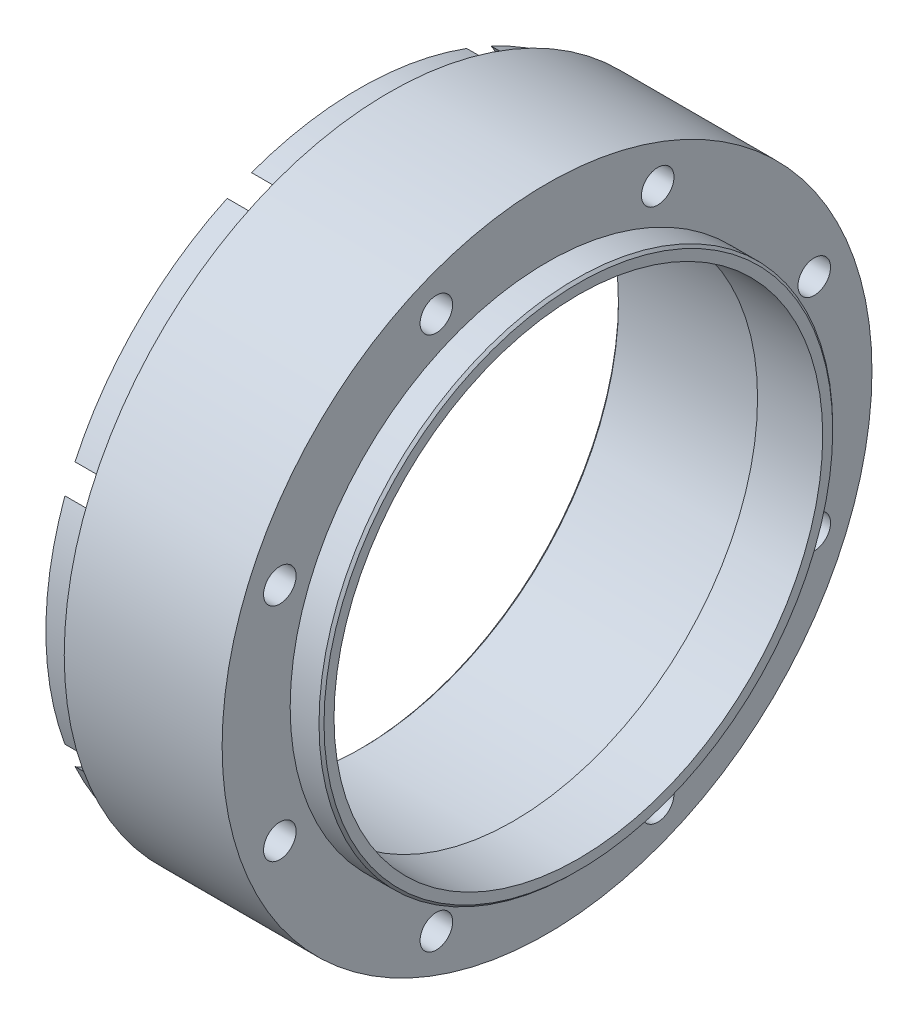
ISO-10303-21;
HEADER;
FILE_DESCRIPTION(('STEP AP214'),'2;1');
FILE_NAME('part.step','',(''),(''),'','','');
FILE_SCHEMA(('AUTOMOTIVE_DESIGN { 1 0 10303 214 1 1 1 1 }'));
ENDSEC;
DATA;
#1=APPLICATION_CONTEXT('core data for automotive mechanical design processes');
#2=APPLICATION_PROTOCOL_DEFINITION('international standard','automotive_design',2000,#1);
#3=PRODUCT_CONTEXT('',#1,'mechanical');
#4=PRODUCT('Part','Part','',(#3));
#5=PRODUCT_RELATED_PRODUCT_CATEGORY('part','',(#4));
#6=PRODUCT_DEFINITION_FORMATION('','',#4);
#7=PRODUCT_DEFINITION_CONTEXT('part definition',#1,'design');
#8=PRODUCT_DEFINITION('design','',#6,#7);
#9=PRODUCT_DEFINITION_SHAPE('','',#8);
#10=(LENGTH_UNIT() NAMED_UNIT(*) SI_UNIT(.MILLI.,.METRE.));
#11=(NAMED_UNIT(*) PLANE_ANGLE_UNIT() SI_UNIT($,.RADIAN.));
#12=(NAMED_UNIT(*) SI_UNIT($,.STERADIAN.) SOLID_ANGLE_UNIT());
#13=UNCERTAINTY_MEASURE_WITH_UNIT(LENGTH_MEASURE(1.E-05),#10,'distance_accuracy_value','');
#14=(GEOMETRIC_REPRESENTATION_CONTEXT(3) GLOBAL_UNCERTAINTY_ASSIGNED_CONTEXT((#13)) GLOBAL_UNIT_ASSIGNED_CONTEXT((#10,
#11,#12)) REPRESENTATION_CONTEXT('',''));
#15=CARTESIAN_POINT('',(0.,0.,0.));
#16=DIRECTION('',(0.,0.,1.));
#17=DIRECTION('',(1.,0.,0.));
#18=AXIS2_PLACEMENT_3D('',#15,#16,#17);
#19=CARTESIAN_POINT('',(-107.95,0.,0.));
#20=DIRECTION('',(1.,0.,0.));
#21=DIRECTION('',(0.,0.,-1.));
#22=AXIS2_PLACEMENT_3D('',#19,#20,#21);
#23=CYLINDRICAL_SURFACE('',#22,49.53);
#24=CARTESIAN_POINT('',(44.45,0.,0.));
#25=DIRECTION('',(1.,0.,0.));
#26=DIRECTION('',(0.,0.,-1.));
#27=AXIS2_PLACEMENT_3D('',#24,#25,#26);
#28=CIRCLE('',#27,49.53);
#29=CARTESIAN_POINT('',(44.45,0.,-49.53));
#30=VERTEX_POINT('',#29);
#31=EDGE_CURVE('E571',#30,#30,#28,.T.);
#32=CARTESIAN_POINT('',(31.242,0.,0.));
#33=DIRECTION('',(-1.,0.,0.));
#34=DIRECTION('',(0.,0.,1.));
#35=AXIS2_PLACEMENT_3D('',#32,#33,#34);
#36=CIRCLE('',#35,49.53);
#37=CARTESIAN_POINT('',(31.242,0.,-49.53));
#38=VERTEX_POINT('',#37);
#39=EDGE_CURVE('E194',#38,#38,#36,.F.);
#40=CARTESIAN_POINT('',(44.45,0.,-49.53));
#41=CARTESIAN_POINT('',(44.3124166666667,0.,-49.53));
#42=CARTESIAN_POINT('',(44.1748333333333,0.,-49.53));
#43=CARTESIAN_POINT('',(43.8996666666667,0.,-49.53));
#44=CARTESIAN_POINT('',(43.7620833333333,0.,-49.53));
#45=CARTESIAN_POINT('',(43.4869166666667,0.,-49.53));
#46=CARTESIAN_POINT('',(43.3493333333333,0.,-49.53));
#47=CARTESIAN_POINT('',(43.0741666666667,0.,-49.53));
#48=CARTESIAN_POINT('',(42.9365833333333,0.,-49.53));
#49=CARTESIAN_POINT('',(42.6614166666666,0.,-49.53));
#50=CARTESIAN_POINT('',(42.5238333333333,0.,-49.53));
#51=CARTESIAN_POINT('',(42.2486666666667,0.,-49.53));
#52=CARTESIAN_POINT('',(42.1110833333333,0.,-49.53));
#53=CARTESIAN_POINT('',(41.8359166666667,0.,-49.53));
#54=CARTESIAN_POINT('',(41.6983333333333,0.,-49.53));
#55=CARTESIAN_POINT('',(41.4231666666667,0.,-49.53));
#56=CARTESIAN_POINT('',(41.2855833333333,0.,-49.53));
#57=CARTESIAN_POINT('',(41.0104166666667,0.,-49.53));
#58=CARTESIAN_POINT('',(40.8728333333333,0.,-49.53));
#59=CARTESIAN_POINT('',(40.5976666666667,0.,-49.53));
#60=CARTESIAN_POINT('',(40.4600833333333,0.,-49.53));
#61=CARTESIAN_POINT('',(40.1849166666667,0.,-49.53));
#62=CARTESIAN_POINT('',(40.0473333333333,0.,-49.53));
#63=CARTESIAN_POINT('',(39.7721666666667,0.,-49.53));
#64=CARTESIAN_POINT('',(39.6345833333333,0.,-49.53));
#65=CARTESIAN_POINT('',(39.3594166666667,0.,-49.53));
#66=CARTESIAN_POINT('',(39.2218333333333,0.,-49.53));
#67=CARTESIAN_POINT('',(38.9466666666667,0.,-49.53));
#68=CARTESIAN_POINT('',(38.8090833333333,0.,-49.53));
#69=CARTESIAN_POINT('',(38.5339166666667,0.,-49.53));
#70=CARTESIAN_POINT('',(38.3963333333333,0.,-49.53));
#71=CARTESIAN_POINT('',(38.1211666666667,0.,-49.53));
#72=CARTESIAN_POINT('',(37.9835833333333,0.,-49.53));
#73=CARTESIAN_POINT('',(37.7084166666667,0.,-49.53));
#74=CARTESIAN_POINT('',(37.5708333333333,0.,-49.53));
#75=CARTESIAN_POINT('',(37.2956666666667,0.,-49.53));
#76=CARTESIAN_POINT('',(37.1580833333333,0.,-49.53));
#77=CARTESIAN_POINT('',(36.8829166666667,0.,-49.53));
#78=CARTESIAN_POINT('',(36.7453333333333,0.,-49.53));
#79=CARTESIAN_POINT('',(36.4701666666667,0.,-49.53));
#80=CARTESIAN_POINT('',(36.3325833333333,0.,-49.53));
#81=CARTESIAN_POINT('',(36.0574166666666,0.,-49.53));
#82=CARTESIAN_POINT('',(35.9198333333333,0.,-49.53));
#83=CARTESIAN_POINT('',(35.6446666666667,0.,-49.53));
#84=CARTESIAN_POINT('',(35.5070833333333,0.,-49.53));
#85=CARTESIAN_POINT('',(35.2319166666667,0.,-49.53));
#86=CARTESIAN_POINT('',(35.0943333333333,0.,-49.53));
#87=CARTESIAN_POINT('',(34.8191666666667,0.,-49.53));
#88=CARTESIAN_POINT('',(34.6815833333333,0.,-49.53));
#89=CARTESIAN_POINT('',(34.4064166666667,0.,-49.53));
#90=CARTESIAN_POINT('',(34.2688333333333,0.,-49.53));
#91=CARTESIAN_POINT('',(33.9936666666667,0.,-49.53));
#92=CARTESIAN_POINT('',(33.8560833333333,0.,-49.53));
#93=CARTESIAN_POINT('',(33.5809166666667,0.,-49.53));
#94=CARTESIAN_POINT('',(33.4433333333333,0.,-49.53));
#95=CARTESIAN_POINT('',(33.1681666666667,0.,-49.53));
#96=CARTESIAN_POINT('',(33.0305833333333,0.,-49.53));
#97=CARTESIAN_POINT('',(32.7554166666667,0.,-49.53));
#98=CARTESIAN_POINT('',(32.6178333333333,0.,-49.53));
#99=CARTESIAN_POINT('',(32.3426666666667,0.,-49.53));
#100=CARTESIAN_POINT('',(32.2050833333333,0.,-49.53));
#101=CARTESIAN_POINT('',(31.9299166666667,0.,-49.53));
#102=CARTESIAN_POINT('',(31.7923333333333,0.,-49.53));
#103=CARTESIAN_POINT('',(31.5171666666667,0.,-49.53));
#104=CARTESIAN_POINT('',(31.3795833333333,0.,-49.53));
#105=CARTESIAN_POINT('',(31.242,0.,-49.53));
#106=B_SPLINE_CURVE_WITH_KNOTS('',3,(#40,#41,#42,#43,#44,#45,#46,#47,#48,#49,#50,#51,#52,#53,
#54,#55,#56,#57,#58,#59,#60,#61,#62,#63,#64,#65,#66,#67,#68,#69,#70,#71,#72,#73,#74,#75,#76,#77,
#78,#79,#80,#81,#82,#83,#84,#85,#86,#87,#88,#89,#90,#91,#92,#93,#94,#95,#96,#97,#98,#99,#100,
#101,#102,#103,#104,#105),.UNSPECIFIED.,.F.,.F.,(4,2,2,2,2,2,2,2,2,2,2,2,2,2,2,2,2,2,2,2,2,2,2,
2,2,2,2,2,2,2,2,2,4),(0.,0.41274999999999,0.825500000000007,1.23825,1.65100000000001,2.06375,
2.47649999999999,2.88925000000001,3.302,3.71474999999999,4.12750000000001,4.54025,
4.95299999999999,5.36575,5.77849999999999,6.19125000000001,6.604,7.01674999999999,
7.42950000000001,7.84224999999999,8.25500000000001,8.66775,9.08049999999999,9.49325000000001,
9.906,10.31875,10.7315,11.14425,11.557,11.96975,12.3825,12.79525,13.208),.UNSPECIFIED.);
#107=EDGE_CURVE('BSEAM40',#30,#38,#106,.T.);
#108=ORIENTED_EDGE('',*,*,#31,.T.);
#109=ORIENTED_EDGE('',*,*,#39,.F.);
#110=ORIENTED_EDGE('',*,*,#107,.T.);
#111=ORIENTED_EDGE('',*,*,#107,.F.);
#112=EDGE_LOOP('',(#108,#110,#109,#111));
#113=FACE_BOUND('',#112,.T.);
#114=ADVANCED_FACE('F40',(#113),#23,.F.);
#115=CARTESIAN_POINT('',(0.,0.,0.));
#116=DIRECTION('',(1.,0.,0.));
#117=DIRECTION('',(0.,0.,-1.));
#118=AXIS2_PLACEMENT_3D('',#115,#116,#117);
#119=PLANE('',#118);
#120=CARTESIAN_POINT('',(0.,0.,0.));
#121=DIRECTION('',(1.,0.,0.));
#122=DIRECTION('',(0.,0.,-1.));
#123=AXIS2_PLACEMENT_3D('',#120,#121,#122);
#124=CIRCLE('',#123,52.5780000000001);
#125=CARTESIAN_POINT('',(0.,0.,-52.5780000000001));
#126=VERTEX_POINT('',#125);
#127=EDGE_CURVE('E12',#126,#126,#124,.T.);
#128=ORIENTED_EDGE('',*,*,#127,.T.);
#129=EDGE_LOOP('',(#128));
#130=FACE_BOUND('',#129,.T.);
#131=CARTESIAN_POINT('',(0.,42.5664140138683,42.5664140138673));
#132=DIRECTION('',(-1.,0.,0.));
#133=DIRECTION('',(0.,0.,1.));
#134=AXIS2_PLACEMENT_3D('',#131,#132,#133);
#135=CIRCLE('',#134,2.1971);
#136=CARTESIAN_POINT('',(0.,42.5664140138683,44.7635140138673));
#137=VERTEX_POINT('',#136);
#138=EDGE_CURVE('E581',#137,#137,#135,.T.);
#139=ORIENTED_EDGE('',*,*,#138,.F.);
#140=EDGE_LOOP('',(#139));
#141=FACE_BOUND('',#140,.T.);
#142=CARTESIAN_POINT('',(0.,6.30540580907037E-13,60.198));
#143=DIRECTION('',(-1.,0.,0.));
#144=DIRECTION('',(0.,0.,1.));
#145=AXIS2_PLACEMENT_3D('',#142,#143,#144);
#146=CIRCLE('',#145,2.1971);
#147=CARTESIAN_POINT('',(0.,6.30540580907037E-13,62.3951));
#148=VERTEX_POINT('',#147);
#149=EDGE_CURVE('E587',#148,#148,#146,.T.);
#150=ORIENTED_EDGE('',*,*,#149,.F.);
#151=EDGE_LOOP('',(#150));
#152=FACE_BOUND('',#151,.T.);
#153=CARTESIAN_POINT('',(0.,-42.5664140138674,42.5664140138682));
#154=DIRECTION('',(-1.,0.,0.));
#155=DIRECTION('',(0.,0.,1.));
#156=AXIS2_PLACEMENT_3D('',#153,#154,#155);
#157=CIRCLE('',#156,2.1971);
#158=CARTESIAN_POINT('',(0.,-42.5664140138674,44.7635140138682));
#159=VERTEX_POINT('',#158);
#160=EDGE_CURVE('E593',#159,#159,#157,.T.);
#161=ORIENTED_EDGE('',*,*,#160,.F.);
#162=EDGE_LOOP('',(#161));
#163=FACE_BOUND('',#162,.T.);
#164=CARTESIAN_POINT('',(0.,-60.198,0.));
#165=DIRECTION('',(-1.,0.,0.));
#166=DIRECTION('',(0.,0.,1.));
#167=AXIS2_PLACEMENT_3D('',#164,#165,#166);
#168=CIRCLE('',#167,2.1971);
#169=CARTESIAN_POINT('',(0.,-60.198,2.1971));
#170=VERTEX_POINT('',#169);
#171=EDGE_CURVE('E599',#170,#170,#168,.T.);
#172=ORIENTED_EDGE('',*,*,#171,.F.);
#173=EDGE_LOOP('',(#172));
#174=FACE_BOUND('',#173,.T.);
#175=CARTESIAN_POINT('',(0.,-42.566414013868,-42.5664140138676));
#176=DIRECTION('',(-1.,0.,0.));
#177=DIRECTION('',(0.,0.,1.));
#178=AXIS2_PLACEMENT_3D('',#175,#176,#177);
#179=CIRCLE('',#178,2.1971);
#180=CARTESIAN_POINT('',(0.,-42.566414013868,-40.3693140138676));
#181=VERTEX_POINT('',#180);
#182=EDGE_CURVE('E605',#181,#181,#179,.T.);
#183=ORIENTED_EDGE('',*,*,#182,.F.);
#184=EDGE_LOOP('',(#183));
#185=FACE_BOUND('',#184,.T.);
#186=CARTESIAN_POINT('',(0.,-2.10180193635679E-13,-60.198));
#187=DIRECTION('',(-1.,0.,0.));
#188=DIRECTION('',(0.,0.,1.));
#189=AXIS2_PLACEMENT_3D('',#186,#187,#188);
#190=CIRCLE('',#189,2.1971);
#191=CARTESIAN_POINT('',(0.,-2.10180193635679E-13,-58.0009));
#192=VERTEX_POINT('',#191);
#193=EDGE_CURVE('E611',#192,#192,#190,.T.);
#194=ORIENTED_EDGE('',*,*,#193,.F.);
#195=EDGE_LOOP('',(#194));
#196=FACE_BOUND('',#195,.T.);
#197=CARTESIAN_POINT('',(0.,42.5664140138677,-42.5664140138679));
#198=DIRECTION('',(-1.,0.,0.));
#199=DIRECTION('',(0.,0.,1.));
#200=AXIS2_PLACEMENT_3D('',#197,#198,#199);
#201=CIRCLE('',#200,2.1971);
#202=CARTESIAN_POINT('',(0.,42.5664140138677,-40.3693140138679));
#203=VERTEX_POINT('',#202);
#204=EDGE_CURVE('E617',#203,#203,#201,.T.);
#205=ORIENTED_EDGE('',*,*,#204,.F.);
#206=EDGE_LOOP('',(#205));
#207=FACE_BOUND('',#206,.T.);
#208=CARTESIAN_POINT('',(0.,60.198,0.));
#209=DIRECTION('',(-1.,0.,0.));
#210=DIRECTION('',(0.,0.,1.));
#211=AXIS2_PLACEMENT_3D('',#208,#209,#210);
#212=CIRCLE('',#211,2.1971);
#213=CARTESIAN_POINT('',(0.,60.198,2.1971));
#214=VERTEX_POINT('',#213);
#215=EDGE_CURVE('E623',#214,#214,#212,.T.);
#216=ORIENTED_EDGE('',*,*,#215,.F.);
#217=EDGE_LOOP('',(#216));
#218=FACE_BOUND('',#217,.T.);
#219=CARTESIAN_POINT('',(0.,22.4348078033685,54.1624172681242));
#220=DIRECTION('',(-1.,0.,0.));
#221=DIRECTION('',(0.,0.,1.));
#222=AXIS2_PLACEMENT_3D('',#219,#220,#221);
#223=CIRCLE('',#222,5.49999999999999);
#224=CARTESIAN_POINT('',(0.,26.7448433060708,57.5790814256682));
#225=VERTEX_POINT('',#224);
#226=CARTESIAN_POINT('',(0.,21.8030988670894,59.6260189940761));
#227=VERTEX_POINT('',#226);
#228=EDGE_CURVE('E179',#225,#227,#223,.T.);
#229=ORIENTED_EDGE('',*,*,#228,.F.);
#230=CARTESIAN_POINT('',(0.,0.,0.));
#231=DIRECTION('',(-1.,0.,0.));
#232=DIRECTION('',(0.,0.,1.));
#233=AXIS2_PLACEMENT_3D('',#230,#231,#232);
#234=CIRCLE('',#233,63.4873);
#235=CARTESIAN_POINT('',(0.,57.5790814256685,26.7448433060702));
#236=VERTEX_POINT('',#235);
#237=EDGE_CURVE('E189',#225,#236,#234,.T.);
#238=ORIENTED_EDGE('',*,*,#237,.T.);
#239=CARTESIAN_POINT('',(0.,54.1624172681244,22.4348078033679));
#240=DIRECTION('',(-1.,0.,0.));
#241=DIRECTION('',(0.,0.,1.));
#242=AXIS2_PLACEMENT_3D('',#239,#240,#241);
#243=CIRCLE('',#242,5.5);
#244=CARTESIAN_POINT('',(0.,59.6260189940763,21.8030988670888));
#245=VERTEX_POINT('',#244);
#246=EDGE_CURVE('E569',#245,#236,#243,.T.);
#247=ORIENTED_EDGE('',*,*,#246,.F.);
#248=CARTESIAN_POINT('',(0.,59.6260189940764,-21.8030988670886));
#249=VERTEX_POINT('',#248);
#250=EDGE_CURVE('E202',#245,#249,#234,.T.);
#251=ORIENTED_EDGE('',*,*,#250,.T.);
#252=CARTESIAN_POINT('',(0.,54.1624172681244,-22.4348078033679));
#253=DIRECTION('',(-1.,0.,0.));
#254=DIRECTION('',(0.,0.,1.));
#255=AXIS2_PLACEMENT_3D('',#252,#253,#254);
#256=CIRCLE('',#255,5.49999999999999);
#257=CARTESIAN_POINT('',(0.,57.5790814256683,-26.7448433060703));
#258=VERTEX_POINT('',#257);
#259=EDGE_CURVE('E558',#258,#249,#256,.T.);
#260=ORIENTED_EDGE('',*,*,#259,.F.);
#261=CARTESIAN_POINT('',(0.,26.74484330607,-57.5790814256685));
#262=VERTEX_POINT('',#261);
#263=EDGE_CURVE('E211',#258,#262,#234,.T.);
#264=ORIENTED_EDGE('',*,*,#263,.T.);
#265=CARTESIAN_POINT('',(0.,22.4348078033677,-54.1624172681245));
#266=DIRECTION('',(-1.,0.,0.));
#267=DIRECTION('',(0.,0.,1.));
#268=AXIS2_PLACEMENT_3D('',#265,#266,#267);
#269=CIRCLE('',#268,5.49999999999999);
#270=CARTESIAN_POINT('',(0.,21.8030988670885,-59.6260189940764));
#271=VERTEX_POINT('',#270);
#272=EDGE_CURVE('E549',#271,#262,#269,.T.);
#273=ORIENTED_EDGE('',*,*,#272,.F.);
#274=CARTESIAN_POINT('',(0.,-21.803098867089,-59.6260189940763));
#275=VERTEX_POINT('',#274);
#276=EDGE_CURVE('E217',#271,#275,#234,.T.);
#277=ORIENTED_EDGE('',*,*,#276,.T.);
#278=CARTESIAN_POINT('',(0.,-22.4348078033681,-54.1624172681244));
#279=DIRECTION('',(-1.,0.,0.));
#280=DIRECTION('',(0.,0.,1.));
#281=AXIS2_PLACEMENT_3D('',#278,#279,#280);
#282=CIRCLE('',#281,5.49999999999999);
#283=CARTESIAN_POINT('',(0.,-26.7448433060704,-57.5790814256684));
#284=VERTEX_POINT('',#283);
#285=EDGE_CURVE('E536',#284,#275,#282,.T.);
#286=ORIENTED_EDGE('',*,*,#285,.F.);
#287=CARTESIAN_POINT('',(0.,-57.5790814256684,-26.7448433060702));
#288=VERTEX_POINT('',#287);
#289=EDGE_CURVE('E221',#284,#288,#234,.T.);
#290=ORIENTED_EDGE('',*,*,#289,.T.);
#291=CARTESIAN_POINT('',(0.,-54.1624172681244,-22.4348078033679));
#292=DIRECTION('',(-1.,0.,0.));
#293=DIRECTION('',(0.,0.,1.));
#294=AXIS2_PLACEMENT_3D('',#291,#292,#293);
#295=CIRCLE('',#294,5.5);
#296=CARTESIAN_POINT('',(0.,-59.6260189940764,-21.8030988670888));
#297=VERTEX_POINT('',#296);
#298=EDGE_CURVE('E525',#297,#288,#295,.T.);
#299=ORIENTED_EDGE('',*,*,#298,.F.);
#300=CARTESIAN_POINT('',(0.,-59.6260189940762,21.8030988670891));
#301=VERTEX_POINT('',#300);
#302=EDGE_CURVE('E225',#297,#301,#234,.T.);
#303=ORIENTED_EDGE('',*,*,#302,.T.);
#304=CARTESIAN_POINT('',(0.,-54.1624172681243,22.4348078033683));
#305=DIRECTION('',(-1.,0.,0.));
#306=DIRECTION('',(0.,0.,1.));
#307=AXIS2_PLACEMENT_3D('',#304,#305,#306);
#308=CIRCLE('',#307,5.49999999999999);
#309=CARTESIAN_POINT('',(0.,-57.5790814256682,26.7448433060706));
#310=VERTEX_POINT('',#309);
#311=EDGE_CURVE('E233',#310,#301,#308,.T.);
#312=ORIENTED_EDGE('',*,*,#311,.F.);
#313=CARTESIAN_POINT('',(0.,-26.7448433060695,57.5790814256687));
#314=VERTEX_POINT('',#313);
#315=EDGE_CURVE('E203',#310,#314,#234,.T.);
#316=ORIENTED_EDGE('',*,*,#315,.T.);
#317=CARTESIAN_POINT('',(0.,-22.4348078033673,54.1624172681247));
#318=DIRECTION('',(-1.,0.,0.));
#319=DIRECTION('',(0.,0.,1.));
#320=AXIS2_PLACEMENT_3D('',#317,#318,#319);
#321=CIRCLE('',#320,5.49999999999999);
#322=CARTESIAN_POINT('',(0.,-21.8030988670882,59.6260189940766));
#323=VERTEX_POINT('',#322);
#324=EDGE_CURVE('E63',#323,#314,#321,.T.);
#325=ORIENTED_EDGE('',*,*,#324,.F.);
#326=EDGE_CURVE('E192',#323,#227,#234,.T.);
#327=ORIENTED_EDGE('',*,*,#326,.T.);
#328=EDGE_LOOP('',(#229,#238,#247,#251,#260,#264,#273,#277,#286,#290,#299,#303,#312,#316,#325,#327));
#329=FACE_BOUND('',#328,.T.);
#330=ADVANCED_FACE('F187',(#130,#141,#152,#163,#174,#185,#196,#207,#218,#329),#119,.F.);
#331=CARTESIAN_POINT('',(6.096,0.,0.));
#332=DIRECTION('',(-1.,0.,0.));
#333=DIRECTION('',(0.,0.,1.));
#334=AXIS2_PLACEMENT_3D('',#331,#332,#333);
#335=CYLINDRICAL_SURFACE('',#334,63.4873);
#336=DIRECTION('',(-1.,0.,0.));
#337=VECTOR('',#336,1.);
#338=CARTESIAN_POINT('',(15.7,26.7448433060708,57.5790814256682));
#339=LINE('',#338,#337);
#340=CARTESIAN_POINT('',(6.096,26.7448433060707,57.5790814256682));
#341=VERTEX_POINT('',#340);
#342=EDGE_CURVE('E175',#341,#225,#339,.T.);
#343=ORIENTED_EDGE('',*,*,#342,.F.);
#344=CARTESIAN_POINT('',(6.096,0.,0.));
#345=DIRECTION('',(-1.,0.,0.));
#346=DIRECTION('',(0.,0.,1.));
#347=AXIS2_PLACEMENT_3D('',#344,#345,#346);
#348=CIRCLE('',#347,63.4873);
#349=CARTESIAN_POINT('',(6.096,57.5790814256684,26.7448433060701));
#350=VERTEX_POINT('',#349);
#351=EDGE_CURVE('E210',#341,#350,#348,.T.);
#352=ORIENTED_EDGE('',*,*,#351,.T.);
#353=DIRECTION('',(-1.,0.,0.));
#354=VECTOR('',#353,1.);
#355=CARTESIAN_POINT('',(15.7,57.5790814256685,26.7448433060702));
#356=LINE('',#355,#354);
#357=EDGE_CURVE('E199',#236,#350,#356,.F.);
#358=ORIENTED_EDGE('',*,*,#357,.F.);
#359=ORIENTED_EDGE('',*,*,#237,.F.);
#360=EDGE_LOOP('',(#343,#352,#358,#359));
#361=FACE_BOUND('',#360,.T.);
#362=ADVANCED_FACE('F197',(#361),#335,.T.);
#363=DIRECTION('',(-1.,0.,0.));
#364=VECTOR('',#363,1.);
#365=CARTESIAN_POINT('',(15.7,21.8030988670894,59.6260189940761));
#366=LINE('',#365,#364);
#367=CARTESIAN_POINT('',(6.096,21.8030988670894,59.6260189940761));
#368=VERTEX_POINT('',#367);
#369=EDGE_CURVE('E55',#227,#368,#366,.F.);
#370=ORIENTED_EDGE('',*,*,#369,.F.);
#371=ORIENTED_EDGE('',*,*,#326,.F.);
#372=DIRECTION('',(-1.,0.,0.));
#373=VECTOR('',#372,1.);
#374=CARTESIAN_POINT('',(15.7,-21.8030988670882,59.6260189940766));
#375=LINE('',#374,#373);
#376=CARTESIAN_POINT('',(6.096,-21.8030988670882,59.6260189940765));
#377=VERTEX_POINT('',#376);
#378=EDGE_CURVE('E243',#377,#323,#375,.T.);
#379=ORIENTED_EDGE('',*,*,#378,.F.);
#380=EDGE_CURVE('E214',#377,#368,#348,.T.);
#381=ORIENTED_EDGE('',*,*,#380,.T.);
#382=EDGE_LOOP('',(#370,#371,#379,#381));
#383=FACE_BOUND('',#382,.T.);
#384=ADVANCED_FACE('F662',(#383),#335,.T.);
#385=DIRECTION('',(-1.,0.,0.));
#386=VECTOR('',#385,1.);
#387=CARTESIAN_POINT('',(15.7,-26.7448433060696,57.5790814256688));
#388=LINE('',#387,#386);
#389=CARTESIAN_POINT('',(6.096,-26.7448433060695,57.5790814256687));
#390=VERTEX_POINT('',#389);
#391=EDGE_CURVE('E240',#314,#390,#388,.F.);
#392=ORIENTED_EDGE('',*,*,#391,.F.);
#393=ORIENTED_EDGE('',*,*,#315,.F.);
#394=DIRECTION('',(-1.,0.,0.));
#395=VECTOR('',#394,1.);
#396=CARTESIAN_POINT('',(15.7,-57.5790814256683,26.7448433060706));
#397=LINE('',#396,#395);
#398=CARTESIAN_POINT('',(6.096,-57.5790814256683,26.7448433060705));
#399=VERTEX_POINT('',#398);
#400=EDGE_CURVE('E238',#399,#310,#397,.T.);
#401=ORIENTED_EDGE('',*,*,#400,.F.);
#402=EDGE_CURVE('E241',#399,#390,#348,.T.);
#403=ORIENTED_EDGE('',*,*,#402,.T.);
#404=EDGE_LOOP('',(#392,#393,#401,#403));
#405=FACE_BOUND('',#404,.T.);
#406=ADVANCED_FACE('F236',(#405),#335,.T.);
#407=DIRECTION('',(-1.,0.,0.));
#408=VECTOR('',#407,1.);
#409=CARTESIAN_POINT('',(15.7,-59.6260189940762,21.8030988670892));
#410=LINE('',#409,#408);
#411=CARTESIAN_POINT('',(6.096,-59.6260189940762,21.8030988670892));
#412=VERTEX_POINT('',#411);
#413=EDGE_CURVE('E522',#301,#412,#410,.F.);
#414=ORIENTED_EDGE('',*,*,#413,.F.);
#415=ORIENTED_EDGE('',*,*,#302,.F.);
#416=DIRECTION('',(-1.,0.,0.));
#417=VECTOR('',#416,1.);
#418=CARTESIAN_POINT('',(15.7,-59.6260189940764,-21.8030988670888));
#419=LINE('',#418,#417);
#420=CARTESIAN_POINT('',(6.096,-59.6260189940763,-21.8030988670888));
#421=VERTEX_POINT('',#420);
#422=EDGE_CURVE('E247',#421,#297,#419,.T.);
#423=ORIENTED_EDGE('',*,*,#422,.F.);
#424=EDGE_CURVE('E648',#421,#412,#348,.T.);
#425=ORIENTED_EDGE('',*,*,#424,.T.);
#426=EDGE_LOOP('',(#414,#415,#423,#425));
#427=FACE_BOUND('',#426,.T.);
#428=ADVANCED_FACE('F741',(#427),#335,.T.);
#429=DIRECTION('',(-1.,0.,0.));
#430=VECTOR('',#429,1.);
#431=CARTESIAN_POINT('',(15.7,-57.5790814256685,-26.7448433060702));
#432=LINE('',#431,#430);
#433=CARTESIAN_POINT('',(6.096,-57.5790814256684,-26.7448433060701));
#434=VERTEX_POINT('',#433);
#435=EDGE_CURVE('E691',#288,#434,#432,.F.);
#436=ORIENTED_EDGE('',*,*,#435,.F.);
#437=ORIENTED_EDGE('',*,*,#289,.F.);
#438=DIRECTION('',(-1.,0.,0.));
#439=VECTOR('',#438,1.);
#440=CARTESIAN_POINT('',(15.7,-26.7448433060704,-57.5790814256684));
#441=LINE('',#440,#439);
#442=CARTESIAN_POINT('',(6.096,-26.7448433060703,-57.5790814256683));
#443=VERTEX_POINT('',#442);
#444=EDGE_CURVE('E547',#443,#284,#441,.T.);
#445=ORIENTED_EDGE('',*,*,#444,.F.);
#446=EDGE_CURVE('E642',#443,#434,#348,.T.);
#447=ORIENTED_EDGE('',*,*,#446,.T.);
#448=EDGE_LOOP('',(#436,#437,#445,#447));
#449=FACE_BOUND('',#448,.T.);
#450=ADVANCED_FACE('F745',(#449),#335,.T.);
#451=DIRECTION('',(-1.,0.,0.));
#452=VECTOR('',#451,1.);
#453=CARTESIAN_POINT('',(15.7,-21.803098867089,-59.6260189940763));
#454=LINE('',#453,#452);
#455=CARTESIAN_POINT('',(6.096,-21.803098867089,-59.6260189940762));
#456=VERTEX_POINT('',#455);
#457=EDGE_CURVE('E545',#275,#456,#454,.F.);
#458=ORIENTED_EDGE('',*,*,#457,.F.);
#459=ORIENTED_EDGE('',*,*,#276,.F.);
#460=DIRECTION('',(-1.,0.,0.));
#461=VECTOR('',#460,1.);
#462=CARTESIAN_POINT('',(15.7,21.8030988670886,-59.6260189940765));
#463=LINE('',#462,#461);
#464=CARTESIAN_POINT('',(6.096,21.8030988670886,-59.6260189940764));
#465=VERTEX_POINT('',#464);
#466=EDGE_CURVE('E683',#465,#271,#463,.T.);
#467=ORIENTED_EDGE('',*,*,#466,.F.);
#468=EDGE_CURVE('E637',#465,#456,#348,.T.);
#469=ORIENTED_EDGE('',*,*,#468,.T.);
#470=EDGE_LOOP('',(#458,#459,#467,#469));
#471=FACE_BOUND('',#470,.T.);
#472=ADVANCED_FACE('F307',(#471),#335,.T.);
#473=DIRECTION('',(-1.,0.,0.));
#474=VECTOR('',#473,1.);
#475=CARTESIAN_POINT('',(15.7,26.74484330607,-57.5790814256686));
#476=LINE('',#475,#474);
#477=CARTESIAN_POINT('',(6.096,26.7448433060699,-57.5790814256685));
#478=VERTEX_POINT('',#477);
#479=EDGE_CURVE('E677',#262,#478,#476,.F.);
#480=ORIENTED_EDGE('',*,*,#479,.F.);
#481=ORIENTED_EDGE('',*,*,#263,.F.);
#482=DIRECTION('',(-1.,0.,0.));
#483=VECTOR('',#482,1.);
#484=CARTESIAN_POINT('',(15.7,57.5790814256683,-26.7448433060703));
#485=LINE('',#484,#483);
#486=CARTESIAN_POINT('',(6.096,57.5790814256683,-26.7448433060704));
#487=VERTEX_POINT('',#486);
#488=EDGE_CURVE('E675',#487,#258,#485,.T.);
#489=ORIENTED_EDGE('',*,*,#488,.F.);
#490=EDGE_CURVE('E631',#487,#478,#348,.T.);
#491=ORIENTED_EDGE('',*,*,#490,.T.);
#492=EDGE_LOOP('',(#480,#481,#489,#491));
#493=FACE_BOUND('',#492,.T.);
#494=ADVANCED_FACE('F302',(#493),#335,.T.);
#495=CARTESIAN_POINT('',(44.45,0.,0.));
#496=DIRECTION('',(-1.,0.,0.));
#497=DIRECTION('',(0.,0.,1.));
#498=AXIS2_PLACEMENT_3D('',#495,#496,#497);
#499=CYLINDRICAL_SURFACE('',#498,65.8622);
#500=CARTESIAN_POINT('',(6.096,0.,0.));
#501=DIRECTION('',(-1.,0.,0.));
#502=DIRECTION('',(0.,0.,1.));
#503=AXIS2_PLACEMENT_3D('',#500,#501,#502);
#504=CIRCLE('',#503,65.8622);
#505=CARTESIAN_POINT('',(6.096,0.,65.8622));
#506=VERTEX_POINT('',#505);
#507=EDGE_CURVE('E313',#506,#506,#504,.T.);
#508=ORIENTED_EDGE('',*,*,#507,.F.);
#509=EDGE_LOOP('',(#508));
#510=FACE_BOUND('',#509,.T.);
#511=CARTESIAN_POINT('',(38.1,0.,0.));
#512=DIRECTION('',(1.,0.,0.));
#513=DIRECTION('',(0.,0.,-1.));
#514=AXIS2_PLACEMENT_3D('',#511,#512,#513);
#515=CIRCLE('',#514,65.8622);
#516=CARTESIAN_POINT('',(38.1,0.,-65.8622));
#517=VERTEX_POINT('',#516);
#518=EDGE_CURVE('E200',#517,#517,#515,.T.);
#519=ORIENTED_EDGE('',*,*,#518,.F.);
#520=EDGE_LOOP('',(#519));
#521=FACE_BOUND('',#520,.T.);
#522=ADVANCED_FACE('F298',(#510,#521),#499,.T.);
#523=CARTESIAN_POINT('',(44.45,0.,0.));
#524=DIRECTION('',(1.,0.,0.));
#525=DIRECTION('',(0.,0.,-1.));
#526=AXIS2_PLACEMENT_3D('',#523,#524,#525);
#527=PLANE('',#526);
#528=CARTESIAN_POINT('',(44.45,0.,0.));
#529=DIRECTION('',(1.,0.,0.));
#530=DIRECTION('',(0.,0.,-1.));
#531=AXIS2_PLACEMENT_3D('',#528,#529,#530);
#532=CIRCLE('',#531,51.562);
#533=CARTESIAN_POINT('',(44.45,0.,-51.562));
#534=VERTEX_POINT('',#533);
#535=EDGE_CURVE('E260',#534,#534,#532,.T.);
#536=ORIENTED_EDGE('',*,*,#535,.T.);
#537=EDGE_LOOP('',(#536));
#538=FACE_BOUND('',#537,.T.);
#539=ORIENTED_EDGE('',*,*,#31,.F.);
#540=EDGE_LOOP('',(#539));
#541=FACE_BOUND('',#540,.T.);
#542=ADVANCED_FACE('F296',(#538,#541),#527,.T.);
#543=CARTESIAN_POINT('',(6.096,0.,0.));
#544=DIRECTION('',(-1.,0.,0.));
#545=DIRECTION('',(0.,0.,1.));
#546=AXIS2_PLACEMENT_3D('',#543,#544,#545);
#547=PLANE('',#546);
#548=CARTESIAN_POINT('',(6.096,22.4348078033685,54.1624172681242));
#549=DIRECTION('',(-1.,0.,0.));
#550=DIRECTION('',(0.,0.,1.));
#551=AXIS2_PLACEMENT_3D('',#548,#549,#550);
#552=CIRCLE('',#551,5.49999999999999);
#553=EDGE_CURVE('E180',#368,#341,#552,.T.);
#554=ORIENTED_EDGE('',*,*,#553,.F.);
#555=ORIENTED_EDGE('',*,*,#380,.F.);
#556=CARTESIAN_POINT('',(6.096,-22.4348078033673,54.1624172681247));
#557=DIRECTION('',(-1.,0.,0.));
#558=DIRECTION('',(0.,0.,1.));
#559=AXIS2_PLACEMENT_3D('',#556,#557,#558);
#560=CIRCLE('',#559,5.49999999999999);
#561=EDGE_CURVE('E254',#390,#377,#560,.T.);
#562=ORIENTED_EDGE('',*,*,#561,.F.);
#563=ORIENTED_EDGE('',*,*,#402,.F.);
#564=CARTESIAN_POINT('',(6.096,-54.1624172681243,22.4348078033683));
#565=DIRECTION('',(-1.,0.,0.));
#566=DIRECTION('',(0.,0.,1.));
#567=AXIS2_PLACEMENT_3D('',#564,#565,#566);
#568=CIRCLE('',#567,5.49999999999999);
#569=EDGE_CURVE('E244',#412,#399,#568,.T.);
#570=ORIENTED_EDGE('',*,*,#569,.F.);
#571=ORIENTED_EDGE('',*,*,#424,.F.);
#572=CARTESIAN_POINT('',(6.096,-54.1624172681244,-22.4348078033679));
#573=DIRECTION('',(-1.,0.,0.));
#574=DIRECTION('',(0.,0.,1.));
#575=AXIS2_PLACEMENT_3D('',#572,#573,#574);
#576=CIRCLE('',#575,5.49999999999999);
#577=EDGE_CURVE('E533',#434,#421,#576,.T.);
#578=ORIENTED_EDGE('',*,*,#577,.F.);
#579=ORIENTED_EDGE('',*,*,#446,.F.);
#580=CARTESIAN_POINT('',(6.096,-22.4348078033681,-54.1624172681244));
#581=DIRECTION('',(-1.,0.,0.));
#582=DIRECTION('',(0.,0.,1.));
#583=AXIS2_PLACEMENT_3D('',#580,#581,#582);
#584=CIRCLE('',#583,5.49999999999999);
#585=EDGE_CURVE('E687',#456,#443,#584,.T.);
#586=ORIENTED_EDGE('',*,*,#585,.F.);
#587=ORIENTED_EDGE('',*,*,#468,.F.);
#588=CARTESIAN_POINT('',(6.096,22.4348078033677,-54.1624172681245));
#589=DIRECTION('',(-1.,0.,0.));
#590=DIRECTION('',(0.,0.,1.));
#591=AXIS2_PLACEMENT_3D('',#588,#589,#590);
#592=CIRCLE('',#591,5.49999999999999);
#593=EDGE_CURVE('E685',#478,#465,#592,.T.);
#594=ORIENTED_EDGE('',*,*,#593,.F.);
#595=ORIENTED_EDGE('',*,*,#490,.F.);
#596=CARTESIAN_POINT('',(6.096,54.1624172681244,-22.4348078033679));
#597=DIRECTION('',(-1.,0.,0.));
#598=DIRECTION('',(0.,0.,1.));
#599=AXIS2_PLACEMENT_3D('',#596,#597,#598);
#600=CIRCLE('',#599,5.49999999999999);
#601=CARTESIAN_POINT('',(6.096,59.6260189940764,-21.8030988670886));
#602=VERTEX_POINT('',#601);
#603=EDGE_CURVE('E566',#602,#487,#600,.T.);
#604=ORIENTED_EDGE('',*,*,#603,.F.);
#605=CARTESIAN_POINT('',(6.096,59.6260189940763,21.8030988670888));
#606=VERTEX_POINT('',#605);
#607=EDGE_CURVE('E215',#606,#602,#348,.T.);
#608=ORIENTED_EDGE('',*,*,#607,.F.);
#609=CARTESIAN_POINT('',(6.096,54.1624172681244,22.4348078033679));
#610=DIRECTION('',(-1.,0.,0.));
#611=DIRECTION('',(0.,0.,1.));
#612=AXIS2_PLACEMENT_3D('',#609,#610,#611);
#613=CIRCLE('',#612,5.49999999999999);
#614=EDGE_CURVE('E578',#350,#606,#613,.T.);
#615=ORIENTED_EDGE('',*,*,#614,.F.);
#616=ORIENTED_EDGE('',*,*,#351,.F.);
#617=EDGE_LOOP('',(#554,#555,#562,#563,#570,#571,#578,#579,#586,#587,#594,#595,#604,#608,#615,#616));
#618=FACE_BOUND('',#617,.T.);
#619=ORIENTED_EDGE('',*,*,#507,.T.);
#620=EDGE_LOOP('',(#619));
#621=FACE_BOUND('',#620,.T.);
#622=ADVANCED_FACE('F294',(#618,#621),#547,.T.);
#623=DIRECTION('',(-1.,0.,0.));
#624=VECTOR('',#623,1.);
#625=CARTESIAN_POINT('',(15.7,59.6260189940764,-21.8030988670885));
#626=LINE('',#625,#624);
#627=EDGE_CURVE('E669',#249,#602,#626,.F.);
#628=ORIENTED_EDGE('',*,*,#627,.F.);
#629=ORIENTED_EDGE('',*,*,#250,.F.);
#630=DIRECTION('',(-1.,0.,0.));
#631=VECTOR('',#630,1.);
#632=CARTESIAN_POINT('',(15.7,59.6260189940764,21.8030988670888));
#633=LINE('',#632,#631);
#634=EDGE_CURVE('E667',#606,#245,#633,.T.);
#635=ORIENTED_EDGE('',*,*,#634,.F.);
#636=ORIENTED_EDGE('',*,*,#607,.T.);
#637=EDGE_LOOP('',(#628,#629,#635,#636));
#638=FACE_BOUND('',#637,.T.);
#639=ADVANCED_FACE('F309',(#638),#335,.T.);
#640=CARTESIAN_POINT('',(38.1,0.,0.));
#641=DIRECTION('',(1.,0.,0.));
#642=DIRECTION('',(0.,0.,-1.));
#643=AXIS2_PLACEMENT_3D('',#640,#641,#642);
#644=PLANE('',#643);
#645=CARTESIAN_POINT('',(38.1,22.4348078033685,54.1624172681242));
#646=DIRECTION('',(1.,0.,0.));
#647=DIRECTION('',(0.,0.,-1.));
#648=AXIS2_PLACEMENT_3D('',#645,#646,#647);
#649=CIRCLE('',#648,3.29999999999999);
#650=CARTESIAN_POINT('',(38.1,22.4348078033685,50.8624172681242));
#651=VERTEX_POINT('',#650);
#652=EDGE_CURVE('E255',#651,#651,#649,.T.);
#653=ORIENTED_EDGE('',*,*,#652,.F.);
#654=EDGE_LOOP('',(#653));
#655=FACE_BOUND('',#654,.T.);
#656=CARTESIAN_POINT('',(38.1,-22.4348078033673,54.1624172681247));
#657=DIRECTION('',(1.,0.,0.));
#658=DIRECTION('',(0.,0.,-1.));
#659=AXIS2_PLACEMENT_3D('',#656,#657,#658);
#660=CIRCLE('',#659,3.29999999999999);
#661=CARTESIAN_POINT('',(38.1,-22.4348078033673,50.8624172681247));
#662=VERTEX_POINT('',#661);
#663=EDGE_CURVE('E251',#662,#662,#660,.T.);
#664=ORIENTED_EDGE('',*,*,#663,.F.);
#665=EDGE_LOOP('',(#664));
#666=FACE_BOUND('',#665,.T.);
#667=CARTESIAN_POINT('',(38.1,-54.1624172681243,22.4348078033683));
#668=DIRECTION('',(1.,0.,0.));
#669=DIRECTION('',(0.,0.,-1.));
#670=AXIS2_PLACEMENT_3D('',#667,#668,#669);
#671=CIRCLE('',#670,3.29999999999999);
#672=CARTESIAN_POINT('',(38.1,-54.1624172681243,19.1348078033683));
#673=VERTEX_POINT('',#672);
#674=EDGE_CURVE('E521',#673,#673,#671,.T.);
#675=ORIENTED_EDGE('',*,*,#674,.F.);
#676=EDGE_LOOP('',(#675));
#677=FACE_BOUND('',#676,.T.);
#678=CARTESIAN_POINT('',(38.1,-54.1624172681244,-22.4348078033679));
#679=DIRECTION('',(1.,0.,0.));
#680=DIRECTION('',(0.,0.,-1.));
#681=AXIS2_PLACEMENT_3D('',#678,#679,#680);
#682=CIRCLE('',#681,3.29999999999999);
#683=CARTESIAN_POINT('',(38.1,-54.1624172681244,-25.7348078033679));
#684=VERTEX_POINT('',#683);
#685=EDGE_CURVE('E535',#684,#684,#682,.T.);
#686=ORIENTED_EDGE('',*,*,#685,.F.);
#687=EDGE_LOOP('',(#686));
#688=FACE_BOUND('',#687,.T.);
#689=CARTESIAN_POINT('',(38.1,-22.4348078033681,-54.1624172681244));
#690=DIRECTION('',(1.,0.,0.));
#691=DIRECTION('',(0.,0.,-1.));
#692=AXIS2_PLACEMENT_3D('',#689,#690,#691);
#693=CIRCLE('',#692,3.29999999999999);
#694=CARTESIAN_POINT('',(38.1,-22.4348078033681,-57.4624172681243));
#695=VERTEX_POINT('',#694);
#696=EDGE_CURVE('E544',#695,#695,#693,.T.);
#697=ORIENTED_EDGE('',*,*,#696,.F.);
#698=EDGE_LOOP('',(#697));
#699=FACE_BOUND('',#698,.T.);
#700=CARTESIAN_POINT('',(38.1,22.4348078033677,-54.1624172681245));
#701=DIRECTION('',(1.,0.,0.));
#702=DIRECTION('',(0.,0.,-1.));
#703=AXIS2_PLACEMENT_3D('',#700,#701,#702);
#704=CIRCLE('',#703,3.29999999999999);
#705=CARTESIAN_POINT('',(38.1,22.4348078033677,-57.4624172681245));
#706=VERTEX_POINT('',#705);
#707=EDGE_CURVE('E557',#706,#706,#704,.T.);
#708=ORIENTED_EDGE('',*,*,#707,.F.);
#709=EDGE_LOOP('',(#708));
#710=FACE_BOUND('',#709,.T.);
#711=CARTESIAN_POINT('',(38.1,54.1624172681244,-22.4348078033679));
#712=DIRECTION('',(1.,0.,0.));
#713=DIRECTION('',(0.,0.,-1.));
#714=AXIS2_PLACEMENT_3D('',#711,#712,#713);
#715=CIRCLE('',#714,3.29999999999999);
#716=CARTESIAN_POINT('',(38.1,54.1624172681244,-25.7348078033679));
#717=VERTEX_POINT('',#716);
#718=EDGE_CURVE('E568',#717,#717,#715,.T.);
#719=ORIENTED_EDGE('',*,*,#718,.F.);
#720=EDGE_LOOP('',(#719));
#721=FACE_BOUND('',#720,.T.);
#722=CARTESIAN_POINT('',(38.1,54.1624172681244,22.4348078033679));
#723=DIRECTION('',(1.,0.,0.));
#724=DIRECTION('',(0.,0.,-1.));
#725=AXIS2_PLACEMENT_3D('',#722,#723,#724);
#726=CIRCLE('',#725,3.29999999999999);
#727=CARTESIAN_POINT('',(38.1,54.1624172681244,19.1348078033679));
#728=VERTEX_POINT('',#727);
#729=EDGE_CURVE('E580',#728,#728,#726,.T.);
#730=ORIENTED_EDGE('',*,*,#729,.F.);
#731=EDGE_LOOP('',(#730));
#732=FACE_BOUND('',#731,.T.);
#733=CARTESIAN_POINT('',(38.1,0.,0.));
#734=DIRECTION('',(1.,0.,0.));
#735=DIRECTION('',(0.,0.,-1.));
#736=AXIS2_PLACEMENT_3D('',#733,#734,#735);
#737=CIRCLE('',#736,52.07);
#738=CARTESIAN_POINT('',(38.1,0.,-52.07));
#739=VERTEX_POINT('',#738);
#740=EDGE_CURVE('E205',#739,#739,#737,.T.);
#741=ORIENTED_EDGE('',*,*,#740,.F.);
#742=EDGE_LOOP('',(#741));
#743=FACE_BOUND('',#742,.T.);
#744=ORIENTED_EDGE('',*,*,#518,.T.);
#745=EDGE_LOOP('',(#744));
#746=FACE_BOUND('',#745,.T.);
#747=ADVANCED_FACE('F316',(#655,#666,#677,#688,#699,#710,#721,#732,#743,#746),#644,.T.);
#748=CARTESIAN_POINT('',(38.1,0.,0.));
#749=DIRECTION('',(1.,0.,0.));
#750=DIRECTION('',(0.,0.,-1.));
#751=AXIS2_PLACEMENT_3D('',#748,#749,#750);
#752=CYLINDRICAL_SURFACE('',#751,52.07);
#753=CARTESIAN_POINT('',(43.942,0.,0.));
#754=DIRECTION('',(1.,0.,0.));
#755=DIRECTION('',(0.,0.,-1.));
#756=AXIS2_PLACEMENT_3D('',#753,#754,#755);
#757=CIRCLE('',#756,52.07);
#758=CARTESIAN_POINT('',(43.942,0.,-52.07));
#759=VERTEX_POINT('',#758);
#760=EDGE_CURVE('E266',#759,#759,#757,.F.);
#761=ORIENTED_EDGE('',*,*,#760,.T.);
#762=EDGE_LOOP('',(#761));
#763=FACE_BOUND('',#762,.T.);
#764=ORIENTED_EDGE('',*,*,#740,.T.);
#765=EDGE_LOOP('',(#764));
#766=FACE_BOUND('',#765,.T.);
#767=ADVANCED_FACE('F318',(#763,#766),#752,.T.);
#768=CARTESIAN_POINT('',(15.5194,60.198,0.));
#769=DIRECTION('',(-1.,0.,0.));
#770=DIRECTION('',(0.,0.,1.));
#771=AXIS2_PLACEMENT_3D('',#768,#769,#770);
#772=CONICAL_SURFACE('',#771,2.19709999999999,1.02974425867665);
#773=CARTESIAN_POINT('',(16.8395508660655,60.198,0.));
#774=VERTEX_POINT('',#773);
#775=VERTEX_LOOP('',#774);
#776=FACE_BOUND('',#775,.T.);
#777=CARTESIAN_POINT('',(15.5194,60.198,0.));
#778=DIRECTION('',(-1.,0.,0.));
#779=DIRECTION('',(0.,0.,1.));
#780=AXIS2_PLACEMENT_3D('',#777,#778,#779);
#781=CIRCLE('',#780,2.19709999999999);
#782=CARTESIAN_POINT('',(15.5194,60.198,2.19709999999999));
#783=VERTEX_POINT('',#782);
#784=EDGE_CURVE('E626',#783,#783,#781,.T.);
#785=ORIENTED_EDGE('',*,*,#784,.T.);
#786=EDGE_LOOP('',(#785));
#787=FACE_BOUND('',#786,.T.);
#788=ADVANCED_FACE('F325',(#776,#787),#772,.F.);
#789=CARTESIAN_POINT('',(0.,60.198,0.));
#790=DIRECTION('',(-1.,0.,0.));
#791=DIRECTION('',(0.,0.,1.));
#792=AXIS2_PLACEMENT_3D('',#789,#790,#791);
#793=CYLINDRICAL_SURFACE('',#792,2.1971);
#794=ORIENTED_EDGE('',*,*,#784,.F.);
#795=EDGE_LOOP('',(#794));
#796=FACE_BOUND('',#795,.T.);
#797=ORIENTED_EDGE('',*,*,#215,.T.);
#798=EDGE_LOOP('',(#797));
#799=FACE_BOUND('',#798,.T.);
#800=ADVANCED_FACE('F334',(#796,#799),#793,.F.);
#801=CARTESIAN_POINT('',(15.5194,42.5664140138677,-42.5664140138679));
#802=DIRECTION('',(-1.,0.,0.));
#803=DIRECTION('',(0.,0.,1.));
#804=AXIS2_PLACEMENT_3D('',#801,#802,#803);
#805=CONICAL_SURFACE('',#804,2.1971,1.02974425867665);
#806=CARTESIAN_POINT('',(16.8395508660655,42.5664140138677,-42.5664140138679));
#807=VERTEX_POINT('',#806);
#808=VERTEX_LOOP('',#807);
#809=FACE_BOUND('',#808,.T.);
#810=CARTESIAN_POINT('',(15.5194,42.5664140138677,-42.5664140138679));
#811=DIRECTION('',(-1.,0.,0.));
#812=DIRECTION('',(0.,0.,1.));
#813=AXIS2_PLACEMENT_3D('',#810,#811,#812);
#814=CIRCLE('',#813,2.1971);
#815=CARTESIAN_POINT('',(15.5194,42.5664140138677,-40.3693140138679));
#816=VERTEX_POINT('',#815);
#817=EDGE_CURVE('E620',#816,#816,#814,.T.);
#818=ORIENTED_EDGE('',*,*,#817,.T.);
#819=EDGE_LOOP('',(#818));
#820=FACE_BOUND('',#819,.T.);
#821=ADVANCED_FACE('F338',(#809,#820),#805,.F.);
#822=CARTESIAN_POINT('',(0.,42.5664140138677,-42.5664140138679));
#823=DIRECTION('',(-1.,0.,0.));
#824=DIRECTION('',(0.,0.,1.));
#825=AXIS2_PLACEMENT_3D('',#822,#823,#824);
#826=CYLINDRICAL_SURFACE('',#825,2.1971);
#827=ORIENTED_EDGE('',*,*,#817,.F.);
#828=EDGE_LOOP('',(#827));
#829=FACE_BOUND('',#828,.T.);
#830=ORIENTED_EDGE('',*,*,#204,.T.);
#831=EDGE_LOOP('',(#830));
#832=FACE_BOUND('',#831,.T.);
#833=ADVANCED_FACE('F342',(#829,#832),#826,.F.);
#834=CARTESIAN_POINT('',(15.5194,-2.10180193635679E-13,-60.198));
#835=DIRECTION('',(-1.,0.,0.));
#836=DIRECTION('',(0.,0.,1.));
#837=AXIS2_PLACEMENT_3D('',#834,#835,#836);
#838=CONICAL_SURFACE('',#837,2.1971,1.02974425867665);
#839=CARTESIAN_POINT('',(16.8395508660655,-2.1430469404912E-13,-60.198));
#840=VERTEX_POINT('',#839);
#841=VERTEX_LOOP('',#840);
#842=FACE_BOUND('',#841,.T.);
#843=CARTESIAN_POINT('',(15.5194,-2.10180193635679E-13,-60.198));
#844=DIRECTION('',(-1.,0.,0.));
#845=DIRECTION('',(0.,0.,1.));
#846=AXIS2_PLACEMENT_3D('',#843,#844,#845);
#847=CIRCLE('',#846,2.1971);
#848=CARTESIAN_POINT('',(15.5194,-2.10180193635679E-13,-58.0009));
#849=VERTEX_POINT('',#848);
#850=EDGE_CURVE('E614',#849,#849,#847,.T.);
#851=ORIENTED_EDGE('',*,*,#850,.T.);
#852=EDGE_LOOP('',(#851));
#853=FACE_BOUND('',#852,.T.);
#854=ADVANCED_FACE('F346',(#842,#853),#838,.F.);
#855=CARTESIAN_POINT('',(0.,-2.10180193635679E-13,-60.198));
#856=DIRECTION('',(-1.,0.,0.));
#857=DIRECTION('',(0.,0.,1.));
#858=AXIS2_PLACEMENT_3D('',#855,#856,#857);
#859=CYLINDRICAL_SURFACE('',#858,2.1971);
#860=ORIENTED_EDGE('',*,*,#850,.F.);
#861=EDGE_LOOP('',(#860));
#862=FACE_BOUND('',#861,.T.);
#863=ORIENTED_EDGE('',*,*,#193,.T.);
#864=EDGE_LOOP('',(#863));
#865=FACE_BOUND('',#864,.T.);
#866=ADVANCED_FACE('F350',(#862,#865),#859,.F.);
#867=CARTESIAN_POINT('',(15.5194,-42.566414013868,-42.5664140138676));
#868=DIRECTION('',(-1.,0.,0.));
#869=DIRECTION('',(0.,0.,1.));
#870=AXIS2_PLACEMENT_3D('',#867,#868,#869);
#871=CONICAL_SURFACE('',#870,2.19709999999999,1.02974425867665);
#872=CARTESIAN_POINT('',(16.8395508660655,-42.566414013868,-42.5664140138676));
#873=VERTEX_POINT('',#872);
#874=VERTEX_LOOP('',#873);
#875=FACE_BOUND('',#874,.T.);
#876=CARTESIAN_POINT('',(15.5194,-42.566414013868,-42.5664140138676));
#877=DIRECTION('',(-1.,0.,0.));
#878=DIRECTION('',(0.,0.,1.));
#879=AXIS2_PLACEMENT_3D('',#876,#877,#878);
#880=CIRCLE('',#879,2.19709999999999);
#881=CARTESIAN_POINT('',(15.5194,-42.566414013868,-40.3693140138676));
#882=VERTEX_POINT('',#881);
#883=EDGE_CURVE('E608',#882,#882,#880,.T.);
#884=ORIENTED_EDGE('',*,*,#883,.T.);
#885=EDGE_LOOP('',(#884));
#886=FACE_BOUND('',#885,.T.);
#887=ADVANCED_FACE('F354',(#875,#886),#871,.F.);
#888=CARTESIAN_POINT('',(0.,-42.566414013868,-42.5664140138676));
#889=DIRECTION('',(-1.,0.,0.));
#890=DIRECTION('',(0.,0.,1.));
#891=AXIS2_PLACEMENT_3D('',#888,#889,#890);
#892=CYLINDRICAL_SURFACE('',#891,2.1971);
#893=ORIENTED_EDGE('',*,*,#883,.F.);
#894=EDGE_LOOP('',(#893));
#895=FACE_BOUND('',#894,.T.);
#896=ORIENTED_EDGE('',*,*,#182,.T.);
#897=EDGE_LOOP('',(#896));
#898=FACE_BOUND('',#897,.T.);
#899=ADVANCED_FACE('F358',(#895,#898),#892,.F.);
#900=CARTESIAN_POINT('',(15.5194,-60.198,0.));
#901=DIRECTION('',(-1.,0.,0.));
#902=DIRECTION('',(0.,0.,1.));
#903=AXIS2_PLACEMENT_3D('',#900,#901,#902);
#904=CONICAL_SURFACE('',#903,2.19709999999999,1.02974425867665);
#905=CARTESIAN_POINT('',(16.8395508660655,-60.198,0.));
#906=VERTEX_POINT('',#905);
#907=VERTEX_LOOP('',#906);
#908=FACE_BOUND('',#907,.T.);
#909=CARTESIAN_POINT('',(15.5194,-60.198,0.));
#910=DIRECTION('',(-1.,0.,0.));
#911=DIRECTION('',(0.,0.,1.));
#912=AXIS2_PLACEMENT_3D('',#909,#910,#911);
#913=CIRCLE('',#912,2.19709999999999);
#914=CARTESIAN_POINT('',(15.5194,-60.198,2.19709999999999));
#915=VERTEX_POINT('',#914);
#916=EDGE_CURVE('E602',#915,#915,#913,.T.);
#917=ORIENTED_EDGE('',*,*,#916,.T.);
#918=EDGE_LOOP('',(#917));
#919=FACE_BOUND('',#918,.T.);
#920=ADVANCED_FACE('F362',(#908,#919),#904,.F.);
#921=CARTESIAN_POINT('',(0.,-60.198,0.));
#922=DIRECTION('',(-1.,0.,0.));
#923=DIRECTION('',(0.,0.,1.));
#924=AXIS2_PLACEMENT_3D('',#921,#922,#923);
#925=CYLINDRICAL_SURFACE('',#924,2.1971);
#926=ORIENTED_EDGE('',*,*,#916,.F.);
#927=EDGE_LOOP('',(#926));
#928=FACE_BOUND('',#927,.T.);
#929=ORIENTED_EDGE('',*,*,#171,.T.);
#930=EDGE_LOOP('',(#929));
#931=FACE_BOUND('',#930,.T.);
#932=ADVANCED_FACE('F366',(#928,#931),#925,.F.);
#933=CARTESIAN_POINT('',(15.5194,-42.5664140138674,42.5664140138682));
#934=DIRECTION('',(-1.,0.,0.));
#935=DIRECTION('',(0.,0.,1.));
#936=AXIS2_PLACEMENT_3D('',#933,#934,#935);
#937=CONICAL_SURFACE('',#936,2.19709999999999,1.02974425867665);
#938=CARTESIAN_POINT('',(16.8395508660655,-42.5664140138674,42.5664140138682));
#939=VERTEX_POINT('',#938);
#940=VERTEX_LOOP('',#939);
#941=FACE_BOUND('',#940,.T.);
#942=CARTESIAN_POINT('',(15.5194,-42.5664140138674,42.5664140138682));
#943=DIRECTION('',(-1.,0.,0.));
#944=DIRECTION('',(0.,0.,1.));
#945=AXIS2_PLACEMENT_3D('',#942,#943,#944);
#946=CIRCLE('',#945,2.19709999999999);
#947=CARTESIAN_POINT('',(15.5194,-42.5664140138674,44.7635140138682));
#948=VERTEX_POINT('',#947);
#949=EDGE_CURVE('E596',#948,#948,#946,.T.);
#950=ORIENTED_EDGE('',*,*,#949,.T.);
#951=EDGE_LOOP('',(#950));
#952=FACE_BOUND('',#951,.T.);
#953=ADVANCED_FACE('F370',(#941,#952),#937,.F.);
#954=CARTESIAN_POINT('',(0.,-42.5664140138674,42.5664140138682));
#955=DIRECTION('',(-1.,0.,0.));
#956=DIRECTION('',(0.,0.,1.));
#957=AXIS2_PLACEMENT_3D('',#954,#955,#956);
#958=CYLINDRICAL_SURFACE('',#957,2.1971);
#959=ORIENTED_EDGE('',*,*,#949,.F.);
#960=EDGE_LOOP('',(#959));
#961=FACE_BOUND('',#960,.T.);
#962=ORIENTED_EDGE('',*,*,#160,.T.);
#963=EDGE_LOOP('',(#962));
#964=FACE_BOUND('',#963,.T.);
#965=ADVANCED_FACE('F374',(#961,#964),#958,.F.);
#966=CARTESIAN_POINT('',(15.5194,6.30540580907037E-13,60.198));
#967=DIRECTION('',(-1.,0.,0.));
#968=DIRECTION('',(0.,0.,1.));
#969=AXIS2_PLACEMENT_3D('',#966,#967,#968);
#970=CONICAL_SURFACE('',#969,2.1971,1.02974425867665);
#971=CARTESIAN_POINT('',(16.8395508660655,6.26416080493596E-13,60.198));
#972=VERTEX_POINT('',#971);
#973=VERTEX_LOOP('',#972);
#974=FACE_BOUND('',#973,.T.);
#975=CARTESIAN_POINT('',(15.5194,6.30540580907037E-13,60.198));
#976=DIRECTION('',(-1.,0.,0.));
#977=DIRECTION('',(0.,0.,1.));
#978=AXIS2_PLACEMENT_3D('',#975,#976,#977);
#979=CIRCLE('',#978,2.1971);
#980=CARTESIAN_POINT('',(15.5194,6.30540580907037E-13,62.3951));
#981=VERTEX_POINT('',#980);
#982=EDGE_CURVE('E590',#981,#981,#979,.T.);
#983=ORIENTED_EDGE('',*,*,#982,.T.);
#984=EDGE_LOOP('',(#983));
#985=FACE_BOUND('',#984,.T.);
#986=ADVANCED_FACE('F378',(#974,#985),#970,.F.);
#987=CARTESIAN_POINT('',(0.,6.30540580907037E-13,60.198));
#988=DIRECTION('',(-1.,0.,0.));
#989=DIRECTION('',(0.,0.,1.));
#990=AXIS2_PLACEMENT_3D('',#987,#988,#989);
#991=CYLINDRICAL_SURFACE('',#990,2.1971);
#992=ORIENTED_EDGE('',*,*,#982,.F.);
#993=EDGE_LOOP('',(#992));
#994=FACE_BOUND('',#993,.T.);
#995=ORIENTED_EDGE('',*,*,#149,.T.);
#996=EDGE_LOOP('',(#995));
#997=FACE_BOUND('',#996,.T.);
#998=ADVANCED_FACE('F382',(#994,#997),#991,.F.);
#999=CARTESIAN_POINT('',(15.5194,42.5664140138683,42.5664140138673));
#1000=DIRECTION('',(-1.,0.,0.));
#1001=DIRECTION('',(0.,0.,1.));
#1002=AXIS2_PLACEMENT_3D('',#999,#1000,#1001);
#1003=CONICAL_SURFACE('',#1002,2.19709999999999,1.02974425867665);
#1004=CARTESIAN_POINT('',(16.8395508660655,42.5664140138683,42.5664140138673));
#1005=VERTEX_POINT('',#1004);
#1006=VERTEX_LOOP('',#1005);
#1007=FACE_BOUND('',#1006,.T.);
#1008=CARTESIAN_POINT('',(15.5194,42.5664140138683,42.5664140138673));
#1009=DIRECTION('',(-1.,0.,0.));
#1010=DIRECTION('',(0.,0.,1.));
#1011=AXIS2_PLACEMENT_3D('',#1008,#1009,#1010);
#1012=CIRCLE('',#1011,2.19709999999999);
#1013=CARTESIAN_POINT('',(15.5194,42.5664140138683,44.7635140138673));
#1014=VERTEX_POINT('',#1013);
#1015=EDGE_CURVE('E584',#1014,#1014,#1012,.T.);
#1016=ORIENTED_EDGE('',*,*,#1015,.T.);
#1017=EDGE_LOOP('',(#1016));
#1018=FACE_BOUND('',#1017,.T.);
#1019=ADVANCED_FACE('F386',(#1007,#1018),#1003,.F.);
#1020=CARTESIAN_POINT('',(0.,42.5664140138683,42.5664140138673));
#1021=DIRECTION('',(-1.,0.,0.));
#1022=DIRECTION('',(0.,0.,1.));
#1023=AXIS2_PLACEMENT_3D('',#1020,#1021,#1022);
#1024=CYLINDRICAL_SURFACE('',#1023,2.1971);
#1025=ORIENTED_EDGE('',*,*,#1015,.F.);
#1026=EDGE_LOOP('',(#1025));
#1027=FACE_BOUND('',#1026,.T.);
#1028=ORIENTED_EDGE('',*,*,#138,.T.);
#1029=EDGE_LOOP('',(#1028));
#1030=FACE_BOUND('',#1029,.T.);
#1031=ADVANCED_FACE('F390',(#1027,#1030),#1024,.F.);
#1032=CARTESIAN_POINT('',(0.,54.1624172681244,22.4348078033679));
#1033=DIRECTION('',(-1.,0.,0.));
#1034=DIRECTION('',(0.,0.,1.));
#1035=AXIS2_PLACEMENT_3D('',#1032,#1033,#1034);
#1036=CYLINDRICAL_SURFACE('',#1035,3.29999999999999);
#1037=ORIENTED_EDGE('',*,*,#729,.T.);
#1038=EDGE_LOOP('',(#1037));
#1039=FACE_BOUND('',#1038,.T.);
#1040=CARTESIAN_POINT('',(31.4,54.1624172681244,22.4348078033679));
#1041=DIRECTION('',(-1.,0.,0.));
#1042=DIRECTION('',(0.,0.,1.));
#1043=AXIS2_PLACEMENT_3D('',#1040,#1041,#1042);
#1044=CIRCLE('',#1043,3.3);
#1045=CARTESIAN_POINT('',(31.4,54.1624172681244,25.7348078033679));
#1046=VERTEX_POINT('',#1045);
#1047=EDGE_CURVE('E575',#1046,#1046,#1044,.T.);
#1048=ORIENTED_EDGE('',*,*,#1047,.T.);
#1049=EDGE_LOOP('',(#1048));
#1050=FACE_BOUND('',#1049,.T.);
#1051=ADVANCED_FACE('F394',(#1039,#1050),#1036,.F.);
#1052=CARTESIAN_POINT('',(31.4,57.4624172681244,22.4348078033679));
#1053=DIRECTION('',(1.,0.,0.));
#1054=DIRECTION('',(0.,0.,-1.));
#1055=AXIS2_PLACEMENT_3D('',#1052,#1053,#1054);
#1056=PLANE('',#1055);
#1057=ORIENTED_EDGE('',*,*,#1047,.F.);
#1058=EDGE_LOOP('',(#1057));
#1059=FACE_BOUND('',#1058,.T.);
#1060=CARTESIAN_POINT('',(31.4,54.1624172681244,22.4348078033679));
#1061=DIRECTION('',(-1.,0.,0.));
#1062=DIRECTION('',(0.,0.,1.));
#1063=AXIS2_PLACEMENT_3D('',#1060,#1061,#1062);
#1064=CIRCLE('',#1063,5.49999999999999);
#1065=CARTESIAN_POINT('',(31.4,54.1624172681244,27.9348078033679));
#1066=VERTEX_POINT('',#1065);
#1067=EDGE_CURVE('E572',#1066,#1066,#1064,.T.);
#1068=ORIENTED_EDGE('',*,*,#1067,.T.);
#1069=EDGE_LOOP('',(#1068));
#1070=FACE_BOUND('',#1069,.T.);
#1071=ADVANCED_FACE('F398',(#1059,#1070),#1056,.F.);
#1072=CARTESIAN_POINT('',(0.,54.1624172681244,22.4348078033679));
#1073=DIRECTION('',(-1.,0.,0.));
#1074=DIRECTION('',(0.,0.,1.));
#1075=AXIS2_PLACEMENT_3D('',#1072,#1073,#1074);
#1076=CYLINDRICAL_SURFACE('',#1075,5.49999999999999);
#1077=ORIENTED_EDGE('',*,*,#634,.T.);
#1078=ORIENTED_EDGE('',*,*,#246,.T.);
#1079=ORIENTED_EDGE('',*,*,#357,.T.);
#1080=ORIENTED_EDGE('',*,*,#614,.T.);
#1081=EDGE_LOOP('',(#1077,#1078,#1079,#1080));
#1082=FACE_BOUND('',#1081,.T.);
#1083=ORIENTED_EDGE('',*,*,#1067,.F.);
#1084=EDGE_LOOP('',(#1083));
#1085=FACE_BOUND('',#1084,.T.);
#1086=ADVANCED_FACE('F402',(#1082,#1085),#1076,.F.);
#1087=CARTESIAN_POINT('',(0.,54.1624172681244,-22.4348078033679));
#1088=DIRECTION('',(-1.,0.,0.));
#1089=DIRECTION('',(0.,0.,1.));
#1090=AXIS2_PLACEMENT_3D('',#1087,#1088,#1089);
#1091=CYLINDRICAL_SURFACE('',#1090,3.29999999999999);
#1092=ORIENTED_EDGE('',*,*,#718,.T.);
#1093=EDGE_LOOP('',(#1092));
#1094=FACE_BOUND('',#1093,.T.);
#1095=CARTESIAN_POINT('',(31.4,54.1624172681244,-22.4348078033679));
#1096=DIRECTION('',(-1.,0.,0.));
#1097=DIRECTION('',(0.,0.,1.));
#1098=AXIS2_PLACEMENT_3D('',#1095,#1096,#1097);
#1099=CIRCLE('',#1098,3.3);
#1100=CARTESIAN_POINT('',(31.4,54.1624172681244,-19.1348078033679));
#1101=VERTEX_POINT('',#1100);
#1102=EDGE_CURVE('E563',#1101,#1101,#1099,.T.);
#1103=ORIENTED_EDGE('',*,*,#1102,.T.);
#1104=EDGE_LOOP('',(#1103));
#1105=FACE_BOUND('',#1104,.T.);
#1106=ADVANCED_FACE('F406',(#1094,#1105),#1091,.F.);
#1107=CARTESIAN_POINT('',(31.4,57.4624172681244,-22.4348078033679));
#1108=DIRECTION('',(1.,0.,0.));
#1109=DIRECTION('',(0.,0.,-1.));
#1110=AXIS2_PLACEMENT_3D('',#1107,#1108,#1109);
#1111=PLANE('',#1110);
#1112=ORIENTED_EDGE('',*,*,#1102,.F.);
#1113=EDGE_LOOP('',(#1112));
#1114=FACE_BOUND('',#1113,.T.);
#1115=CARTESIAN_POINT('',(31.4,54.1624172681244,-22.4348078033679));
#1116=DIRECTION('',(-1.,0.,0.));
#1117=DIRECTION('',(0.,0.,1.));
#1118=AXIS2_PLACEMENT_3D('',#1115,#1116,#1117);
#1119=CIRCLE('',#1118,5.49999999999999);
#1120=CARTESIAN_POINT('',(31.4,54.1624172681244,-16.9348078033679));
#1121=VERTEX_POINT('',#1120);
#1122=EDGE_CURVE('E560',#1121,#1121,#1119,.T.);
#1123=ORIENTED_EDGE('',*,*,#1122,.T.);
#1124=EDGE_LOOP('',(#1123));
#1125=FACE_BOUND('',#1124,.T.);
#1126=ADVANCED_FACE('F410',(#1114,#1125),#1111,.F.);
#1127=CARTESIAN_POINT('',(0.,54.1624172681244,-22.4348078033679));
#1128=DIRECTION('',(-1.,0.,0.));
#1129=DIRECTION('',(0.,0.,1.));
#1130=AXIS2_PLACEMENT_3D('',#1127,#1128,#1129);
#1131=CYLINDRICAL_SURFACE('',#1130,5.49999999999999);
#1132=ORIENTED_EDGE('',*,*,#488,.T.);
#1133=ORIENTED_EDGE('',*,*,#259,.T.);
#1134=ORIENTED_EDGE('',*,*,#627,.T.);
#1135=ORIENTED_EDGE('',*,*,#603,.T.);
#1136=EDGE_LOOP('',(#1132,#1133,#1134,#1135));
#1137=FACE_BOUND('',#1136,.T.);
#1138=ORIENTED_EDGE('',*,*,#1122,.F.);
#1139=EDGE_LOOP('',(#1138));
#1140=FACE_BOUND('',#1139,.T.);
#1141=ADVANCED_FACE('F414',(#1137,#1140),#1131,.F.);
#1142=CARTESIAN_POINT('',(0.,22.4348078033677,-54.1624172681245));
#1143=DIRECTION('',(-1.,0.,0.));
#1144=DIRECTION('',(0.,0.,1.));
#1145=AXIS2_PLACEMENT_3D('',#1142,#1143,#1144);
#1146=CYLINDRICAL_SURFACE('',#1145,3.29999999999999);
#1147=ORIENTED_EDGE('',*,*,#707,.T.);
#1148=EDGE_LOOP('',(#1147));
#1149=FACE_BOUND('',#1148,.T.);
#1150=CARTESIAN_POINT('',(31.4,22.4348078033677,-54.1624172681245));
#1151=DIRECTION('',(-1.,0.,0.));
#1152=DIRECTION('',(0.,0.,1.));
#1153=AXIS2_PLACEMENT_3D('',#1150,#1151,#1152);
#1154=CIRCLE('',#1153,3.29999999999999);
#1155=CARTESIAN_POINT('',(31.4,22.4348078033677,-50.8624172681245));
#1156=VERTEX_POINT('',#1155);
#1157=EDGE_CURVE('E554',#1156,#1156,#1154,.T.);
#1158=ORIENTED_EDGE('',*,*,#1157,.T.);
#1159=EDGE_LOOP('',(#1158));
#1160=FACE_BOUND('',#1159,.T.);
#1161=ADVANCED_FACE('F418',(#1149,#1160),#1146,.F.);
#1162=CARTESIAN_POINT('',(31.4,25.7348078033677,-54.1624172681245));
#1163=DIRECTION('',(1.,0.,0.));
#1164=DIRECTION('',(0.,0.,-1.));
#1165=AXIS2_PLACEMENT_3D('',#1162,#1163,#1164);
#1166=PLANE('',#1165);
#1167=ORIENTED_EDGE('',*,*,#1157,.F.);
#1168=EDGE_LOOP('',(#1167));
#1169=FACE_BOUND('',#1168,.T.);
#1170=CARTESIAN_POINT('',(31.4,22.4348078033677,-54.1624172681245));
#1171=DIRECTION('',(-1.,0.,0.));
#1172=DIRECTION('',(0.,0.,1.));
#1173=AXIS2_PLACEMENT_3D('',#1170,#1171,#1172);
#1174=CIRCLE('',#1173,5.49999999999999);
#1175=CARTESIAN_POINT('',(31.4,22.4348078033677,-48.6624172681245));
#1176=VERTEX_POINT('',#1175);
#1177=EDGE_CURVE('E551',#1176,#1176,#1174,.T.);
#1178=ORIENTED_EDGE('',*,*,#1177,.T.);
#1179=EDGE_LOOP('',(#1178));
#1180=FACE_BOUND('',#1179,.T.);
#1181=ADVANCED_FACE('F422',(#1169,#1180),#1166,.F.);
#1182=CARTESIAN_POINT('',(0.,22.4348078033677,-54.1624172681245));
#1183=DIRECTION('',(-1.,0.,0.));
#1184=DIRECTION('',(0.,0.,1.));
#1185=AXIS2_PLACEMENT_3D('',#1182,#1183,#1184);
#1186=CYLINDRICAL_SURFACE('',#1185,5.49999999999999);
#1187=ORIENTED_EDGE('',*,*,#466,.T.);
#1188=ORIENTED_EDGE('',*,*,#272,.T.);
#1189=ORIENTED_EDGE('',*,*,#479,.T.);
#1190=ORIENTED_EDGE('',*,*,#593,.T.);
#1191=EDGE_LOOP('',(#1187,#1188,#1189,#1190));
#1192=FACE_BOUND('',#1191,.T.);
#1193=ORIENTED_EDGE('',*,*,#1177,.F.);
#1194=EDGE_LOOP('',(#1193));
#1195=FACE_BOUND('',#1194,.T.);
#1196=ADVANCED_FACE('F426',(#1192,#1195),#1186,.F.);
#1197=CARTESIAN_POINT('',(0.,-22.4348078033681,-54.1624172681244));
#1198=DIRECTION('',(-1.,0.,0.));
#1199=DIRECTION('',(0.,0.,1.));
#1200=AXIS2_PLACEMENT_3D('',#1197,#1198,#1199);
#1201=CYLINDRICAL_SURFACE('',#1200,3.29999999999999);
#1202=ORIENTED_EDGE('',*,*,#696,.T.);
#1203=EDGE_LOOP('',(#1202));
#1204=FACE_BOUND('',#1203,.T.);
#1205=CARTESIAN_POINT('',(31.4,-22.4348078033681,-54.1624172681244));
#1206=DIRECTION('',(-1.,0.,0.));
#1207=DIRECTION('',(0.,0.,1.));
#1208=AXIS2_PLACEMENT_3D('',#1205,#1206,#1207);
#1209=CIRCLE('',#1208,3.29999999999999);
#1210=CARTESIAN_POINT('',(31.4,-22.4348078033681,-50.8624172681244));
#1211=VERTEX_POINT('',#1210);
#1212=EDGE_CURVE('E541',#1211,#1211,#1209,.T.);
#1213=ORIENTED_EDGE('',*,*,#1212,.T.);
#1214=EDGE_LOOP('',(#1213));
#1215=FACE_BOUND('',#1214,.T.);
#1216=ADVANCED_FACE('F430',(#1204,#1215),#1201,.F.);
#1217=CARTESIAN_POINT('',(31.4,-19.1348078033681,-54.1624172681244));
#1218=DIRECTION('',(1.,0.,0.));
#1219=DIRECTION('',(0.,0.,-1.));
#1220=AXIS2_PLACEMENT_3D('',#1217,#1218,#1219);
#1221=PLANE('',#1220);
#1222=ORIENTED_EDGE('',*,*,#1212,.F.);
#1223=EDGE_LOOP('',(#1222));
#1224=FACE_BOUND('',#1223,.T.);
#1225=CARTESIAN_POINT('',(31.4,-22.4348078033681,-54.1624172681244));
#1226=DIRECTION('',(-1.,0.,0.));
#1227=DIRECTION('',(0.,0.,1.));
#1228=AXIS2_PLACEMENT_3D('',#1225,#1226,#1227);
#1229=CIRCLE('',#1228,5.49999999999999);
#1230=CARTESIAN_POINT('',(31.4,-22.4348078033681,-48.6624172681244));
#1231=VERTEX_POINT('',#1230);
#1232=EDGE_CURVE('E538',#1231,#1231,#1229,.T.);
#1233=ORIENTED_EDGE('',*,*,#1232,.T.);
#1234=EDGE_LOOP('',(#1233));
#1235=FACE_BOUND('',#1234,.T.);
#1236=ADVANCED_FACE('F434',(#1224,#1235),#1221,.F.);
#1237=CARTESIAN_POINT('',(0.,-22.4348078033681,-54.1624172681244));
#1238=DIRECTION('',(-1.,0.,0.));
#1239=DIRECTION('',(0.,0.,1.));
#1240=AXIS2_PLACEMENT_3D('',#1237,#1238,#1239);
#1241=CYLINDRICAL_SURFACE('',#1240,5.49999999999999);
#1242=ORIENTED_EDGE('',*,*,#444,.T.);
#1243=ORIENTED_EDGE('',*,*,#285,.T.);
#1244=ORIENTED_EDGE('',*,*,#457,.T.);
#1245=ORIENTED_EDGE('',*,*,#585,.T.);
#1246=EDGE_LOOP('',(#1242,#1243,#1244,#1245));
#1247=FACE_BOUND('',#1246,.T.);
#1248=ORIENTED_EDGE('',*,*,#1232,.F.);
#1249=EDGE_LOOP('',(#1248));
#1250=FACE_BOUND('',#1249,.T.);
#1251=ADVANCED_FACE('F438',(#1247,#1250),#1241,.F.);
#1252=CARTESIAN_POINT('',(0.,-54.1624172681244,-22.4348078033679));
#1253=DIRECTION('',(-1.,0.,0.));
#1254=DIRECTION('',(0.,0.,1.));
#1255=AXIS2_PLACEMENT_3D('',#1252,#1253,#1254);
#1256=CYLINDRICAL_SURFACE('',#1255,3.29999999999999);
#1257=ORIENTED_EDGE('',*,*,#685,.T.);
#1258=EDGE_LOOP('',(#1257));
#1259=FACE_BOUND('',#1258,.T.);
#1260=CARTESIAN_POINT('',(31.4,-54.1624172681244,-22.4348078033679));
#1261=DIRECTION('',(-1.,0.,0.));
#1262=DIRECTION('',(0.,0.,1.));
#1263=AXIS2_PLACEMENT_3D('',#1260,#1261,#1262);
#1264=CIRCLE('',#1263,3.3);
#1265=CARTESIAN_POINT('',(31.4,-54.1624172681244,-19.1348078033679));
#1266=VERTEX_POINT('',#1265);
#1267=EDGE_CURVE('E530',#1266,#1266,#1264,.T.);
#1268=ORIENTED_EDGE('',*,*,#1267,.T.);
#1269=EDGE_LOOP('',(#1268));
#1270=FACE_BOUND('',#1269,.T.);
#1271=ADVANCED_FACE('F442',(#1259,#1270),#1256,.F.);
#1272=CARTESIAN_POINT('',(31.4,-50.8624172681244,-22.4348078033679));
#1273=DIRECTION('',(1.,0.,0.));
#1274=DIRECTION('',(0.,0.,-1.));
#1275=AXIS2_PLACEMENT_3D('',#1272,#1273,#1274);
#1276=PLANE('',#1275);
#1277=ORIENTED_EDGE('',*,*,#1267,.F.);
#1278=EDGE_LOOP('',(#1277));
#1279=FACE_BOUND('',#1278,.T.);
#1280=CARTESIAN_POINT('',(31.4,-54.1624172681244,-22.4348078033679));
#1281=DIRECTION('',(-1.,0.,0.));
#1282=DIRECTION('',(0.,0.,1.));
#1283=AXIS2_PLACEMENT_3D('',#1280,#1281,#1282);
#1284=CIRCLE('',#1283,5.49999999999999);
#1285=CARTESIAN_POINT('',(31.4,-54.1624172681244,-16.9348078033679));
#1286=VERTEX_POINT('',#1285);
#1287=EDGE_CURVE('E527',#1286,#1286,#1284,.T.);
#1288=ORIENTED_EDGE('',*,*,#1287,.T.);
#1289=EDGE_LOOP('',(#1288));
#1290=FACE_BOUND('',#1289,.T.);
#1291=ADVANCED_FACE('F446',(#1279,#1290),#1276,.F.);
#1292=CARTESIAN_POINT('',(0.,-54.1624172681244,-22.4348078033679));
#1293=DIRECTION('',(-1.,0.,0.));
#1294=DIRECTION('',(0.,0.,1.));
#1295=AXIS2_PLACEMENT_3D('',#1292,#1293,#1294);
#1296=CYLINDRICAL_SURFACE('',#1295,5.49999999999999);
#1297=ORIENTED_EDGE('',*,*,#422,.T.);
#1298=ORIENTED_EDGE('',*,*,#298,.T.);
#1299=ORIENTED_EDGE('',*,*,#435,.T.);
#1300=ORIENTED_EDGE('',*,*,#577,.T.);
#1301=EDGE_LOOP('',(#1297,#1298,#1299,#1300));
#1302=FACE_BOUND('',#1301,.T.);
#1303=ORIENTED_EDGE('',*,*,#1287,.F.);
#1304=EDGE_LOOP('',(#1303));
#1305=FACE_BOUND('',#1304,.T.);
#1306=ADVANCED_FACE('F450',(#1302,#1305),#1296,.F.);
#1307=CARTESIAN_POINT('',(0.,-54.1624172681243,22.4348078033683));
#1308=DIRECTION('',(-1.,0.,0.));
#1309=DIRECTION('',(0.,0.,1.));
#1310=AXIS2_PLACEMENT_3D('',#1307,#1308,#1309);
#1311=CYLINDRICAL_SURFACE('',#1310,3.29999999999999);
#1312=ORIENTED_EDGE('',*,*,#674,.T.);
#1313=EDGE_LOOP('',(#1312));
#1314=FACE_BOUND('',#1313,.T.);
#1315=CARTESIAN_POINT('',(31.4,-54.1624172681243,22.4348078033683));
#1316=DIRECTION('',(-1.,0.,0.));
#1317=DIRECTION('',(0.,0.,1.));
#1318=AXIS2_PLACEMENT_3D('',#1315,#1316,#1317);
#1319=CIRCLE('',#1318,3.3);
#1320=CARTESIAN_POINT('',(31.4,-54.1624172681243,25.7348078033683));
#1321=VERTEX_POINT('',#1320);
#1322=EDGE_CURVE('E518',#1321,#1321,#1319,.T.);
#1323=ORIENTED_EDGE('',*,*,#1322,.T.);
#1324=EDGE_LOOP('',(#1323));
#1325=FACE_BOUND('',#1324,.T.);
#1326=ADVANCED_FACE('F454',(#1314,#1325),#1311,.F.);
#1327=CARTESIAN_POINT('',(31.4,-50.8624172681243,22.4348078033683));
#1328=DIRECTION('',(1.,0.,0.));
#1329=DIRECTION('',(0.,0.,-1.));
#1330=AXIS2_PLACEMENT_3D('',#1327,#1328,#1329);
#1331=PLANE('',#1330);
#1332=ORIENTED_EDGE('',*,*,#1322,.F.);
#1333=EDGE_LOOP('',(#1332));
#1334=FACE_BOUND('',#1333,.T.);
#1335=CARTESIAN_POINT('',(31.4,-54.1624172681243,22.4348078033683));
#1336=DIRECTION('',(-1.,0.,0.));
#1337=DIRECTION('',(0.,0.,1.));
#1338=AXIS2_PLACEMENT_3D('',#1335,#1336,#1337);
#1339=CIRCLE('',#1338,5.49999999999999);
#1340=CARTESIAN_POINT('',(31.4,-54.1624172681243,27.9348078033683));
#1341=VERTEX_POINT('',#1340);
#1342=EDGE_CURVE('E515',#1341,#1341,#1339,.T.);
#1343=ORIENTED_EDGE('',*,*,#1342,.T.);
#1344=EDGE_LOOP('',(#1343));
#1345=FACE_BOUND('',#1344,.T.);
#1346=ADVANCED_FACE('F458',(#1334,#1345),#1331,.F.);
#1347=CARTESIAN_POINT('',(0.,-54.1624172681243,22.4348078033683));
#1348=DIRECTION('',(-1.,0.,0.));
#1349=DIRECTION('',(0.,0.,1.));
#1350=AXIS2_PLACEMENT_3D('',#1347,#1348,#1349);
#1351=CYLINDRICAL_SURFACE('',#1350,5.49999999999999);
#1352=ORIENTED_EDGE('',*,*,#400,.T.);
#1353=ORIENTED_EDGE('',*,*,#311,.T.);
#1354=ORIENTED_EDGE('',*,*,#413,.T.);
#1355=ORIENTED_EDGE('',*,*,#569,.T.);
#1356=EDGE_LOOP('',(#1352,#1353,#1354,#1355));
#1357=FACE_BOUND('',#1356,.T.);
#1358=ORIENTED_EDGE('',*,*,#1342,.F.);
#1359=EDGE_LOOP('',(#1358));
#1360=FACE_BOUND('',#1359,.T.);
#1361=ADVANCED_FACE('F462',(#1357,#1360),#1351,.F.);
#1362=CARTESIAN_POINT('',(0.,-22.4348078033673,54.1624172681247));
#1363=DIRECTION('',(-1.,0.,0.));
#1364=DIRECTION('',(0.,0.,1.));
#1365=AXIS2_PLACEMENT_3D('',#1362,#1363,#1364);
#1366=CYLINDRICAL_SURFACE('',#1365,3.29999999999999);
#1367=ORIENTED_EDGE('',*,*,#663,.T.);
#1368=EDGE_LOOP('',(#1367));
#1369=FACE_BOUND('',#1368,.T.);
#1370=CARTESIAN_POINT('',(31.4,-22.4348078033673,54.1624172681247));
#1371=DIRECTION('',(-1.,0.,0.));
#1372=DIRECTION('',(0.,0.,1.));
#1373=AXIS2_PLACEMENT_3D('',#1370,#1371,#1372);
#1374=CIRCLE('',#1373,3.29999999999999);
#1375=CARTESIAN_POINT('',(31.4,-22.4348078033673,57.4624172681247));
#1376=VERTEX_POINT('',#1375);
#1377=EDGE_CURVE('E510',#1376,#1376,#1374,.T.);
#1378=ORIENTED_EDGE('',*,*,#1377,.T.);
#1379=EDGE_LOOP('',(#1378));
#1380=FACE_BOUND('',#1379,.T.);
#1381=ADVANCED_FACE('F466',(#1369,#1380),#1366,.F.);
#1382=CARTESIAN_POINT('',(31.4,-19.1348078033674,54.1624172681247));
#1383=DIRECTION('',(1.,0.,0.));
#1384=DIRECTION('',(0.,0.,-1.));
#1385=AXIS2_PLACEMENT_3D('',#1382,#1383,#1384);
#1386=PLANE('',#1385);
#1387=ORIENTED_EDGE('',*,*,#1377,.F.);
#1388=EDGE_LOOP('',(#1387));
#1389=FACE_BOUND('',#1388,.T.);
#1390=CARTESIAN_POINT('',(31.4,-22.4348078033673,54.1624172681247));
#1391=DIRECTION('',(-1.,0.,0.));
#1392=DIRECTION('',(0.,0.,1.));
#1393=AXIS2_PLACEMENT_3D('',#1390,#1391,#1392);
#1394=CIRCLE('',#1393,5.49999999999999);
#1395=CARTESIAN_POINT('',(31.4,-22.4348078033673,59.6624172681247));
#1396=VERTEX_POINT('',#1395);
#1397=EDGE_CURVE('E507',#1396,#1396,#1394,.T.);
#1398=ORIENTED_EDGE('',*,*,#1397,.T.);
#1399=EDGE_LOOP('',(#1398));
#1400=FACE_BOUND('',#1399,.T.);
#1401=ADVANCED_FACE('F470',(#1389,#1400),#1386,.F.);
#1402=CARTESIAN_POINT('',(0.,-22.4348078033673,54.1624172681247));
#1403=DIRECTION('',(-1.,0.,0.));
#1404=DIRECTION('',(0.,0.,1.));
#1405=AXIS2_PLACEMENT_3D('',#1402,#1403,#1404);
#1406=CYLINDRICAL_SURFACE('',#1405,5.49999999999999);
#1407=ORIENTED_EDGE('',*,*,#378,.T.);
#1408=ORIENTED_EDGE('',*,*,#324,.T.);
#1409=ORIENTED_EDGE('',*,*,#391,.T.);
#1410=ORIENTED_EDGE('',*,*,#561,.T.);
#1411=EDGE_LOOP('',(#1407,#1408,#1409,#1410));
#1412=FACE_BOUND('',#1411,.T.);
#1413=ORIENTED_EDGE('',*,*,#1397,.F.);
#1414=EDGE_LOOP('',(#1413));
#1415=FACE_BOUND('',#1414,.T.);
#1416=ADVANCED_FACE('F474',(#1412,#1415),#1406,.F.);
#1417=CARTESIAN_POINT('',(0.,22.4348078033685,54.1624172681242));
#1418=DIRECTION('',(-1.,0.,0.));
#1419=DIRECTION('',(0.,0.,1.));
#1420=AXIS2_PLACEMENT_3D('',#1417,#1418,#1419);
#1421=CYLINDRICAL_SURFACE('',#1420,3.29999999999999);
#1422=ORIENTED_EDGE('',*,*,#652,.T.);
#1423=EDGE_LOOP('',(#1422));
#1424=FACE_BOUND('',#1423,.T.);
#1425=CARTESIAN_POINT('',(31.4,22.4348078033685,54.1624172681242));
#1426=DIRECTION('',(-1.,0.,0.));
#1427=DIRECTION('',(0.,0.,1.));
#1428=AXIS2_PLACEMENT_3D('',#1425,#1426,#1427);
#1429=CIRCLE('',#1428,3.29999999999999);
#1430=CARTESIAN_POINT('',(31.4,22.4348078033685,57.4624172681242));
#1431=VERTEX_POINT('',#1430);
#1432=EDGE_CURVE('E258',#1431,#1431,#1429,.T.);
#1433=ORIENTED_EDGE('',*,*,#1432,.T.);
#1434=EDGE_LOOP('',(#1433));
#1435=FACE_BOUND('',#1434,.T.);
#1436=ADVANCED_FACE('F478',(#1424,#1435),#1421,.F.);
#1437=CARTESIAN_POINT('',(31.4,25.7348078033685,54.1624172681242));
#1438=DIRECTION('',(1.,0.,0.));
#1439=DIRECTION('',(0.,0.,-1.));
#1440=AXIS2_PLACEMENT_3D('',#1437,#1438,#1439);
#1441=PLANE('',#1440);
#1442=ORIENTED_EDGE('',*,*,#1432,.F.);
#1443=EDGE_LOOP('',(#1442));
#1444=FACE_BOUND('',#1443,.T.);
#1445=CARTESIAN_POINT('',(31.4,22.4348078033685,54.1624172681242));
#1446=DIRECTION('',(-1.,0.,0.));
#1447=DIRECTION('',(0.,0.,1.));
#1448=AXIS2_PLACEMENT_3D('',#1445,#1446,#1447);
#1449=CIRCLE('',#1448,5.49999999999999);
#1450=CARTESIAN_POINT('',(31.4,22.4348078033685,59.6624172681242));
#1451=VERTEX_POINT('',#1450);
#1452=EDGE_CURVE('E193',#1451,#1451,#1449,.T.);
#1453=ORIENTED_EDGE('',*,*,#1452,.T.);
#1454=EDGE_LOOP('',(#1453));
#1455=FACE_BOUND('',#1454,.T.);
#1456=ADVANCED_FACE('F481',(#1444,#1455),#1441,.F.);
#1457=CARTESIAN_POINT('',(0.,22.4348078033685,54.1624172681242));
#1458=DIRECTION('',(-1.,0.,0.));
#1459=DIRECTION('',(0.,0.,1.));
#1460=AXIS2_PLACEMENT_3D('',#1457,#1458,#1459);
#1461=CYLINDRICAL_SURFACE('',#1460,5.49999999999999);
#1462=ORIENTED_EDGE('',*,*,#342,.T.);
#1463=ORIENTED_EDGE('',*,*,#228,.T.);
#1464=ORIENTED_EDGE('',*,*,#369,.T.);
#1465=ORIENTED_EDGE('',*,*,#553,.T.);
#1466=EDGE_LOOP('',(#1462,#1463,#1464,#1465));
#1467=FACE_BOUND('',#1466,.T.);
#1468=ORIENTED_EDGE('',*,*,#1452,.F.);
#1469=EDGE_LOOP('',(#1468));
#1470=FACE_BOUND('',#1469,.T.);
#1471=ADVANCED_FACE('F177',(#1467,#1470),#1461,.F.);
#1472=CARTESIAN_POINT('',(31.242,0.,0.));
#1473=DIRECTION('',(-1.,0.,0.));
#1474=DIRECTION('',(0.,0.,1.));
#1475=AXIS2_PLACEMENT_3D('',#1472,#1473,#1474);
#1476=PLANE('',#1475);
#1477=CARTESIAN_POINT('',(31.242,0.,0.));
#1478=DIRECTION('',(-1.,0.,0.));
#1479=DIRECTION('',(0.,0.,1.));
#1480=AXIS2_PLACEMENT_3D('',#1477,#1478,#1479);
#1481=CIRCLE('',#1480,52.07);
#1482=CARTESIAN_POINT('',(31.242,0.,52.07));
#1483=VERTEX_POINT('',#1482);
#1484=EDGE_CURVE('E263',#1483,#1483,#1481,.T.);
#1485=ORIENTED_EDGE('',*,*,#1484,.T.);
#1486=EDGE_LOOP('',(#1485));
#1487=FACE_BOUND('',#1486,.T.);
#1488=ORIENTED_EDGE('',*,*,#39,.T.);
#1489=EDGE_LOOP('',(#1488));
#1490=FACE_BOUND('',#1489,.T.);
#1491=ADVANCED_FACE('F488',(#1487,#1490),#1476,.T.);
#1492=CARTESIAN_POINT('',(31.242,0.,0.));
#1493=DIRECTION('',(-1.,0.,0.));
#1494=DIRECTION('',(0.,0.,1.));
#1495=AXIS2_PLACEMENT_3D('',#1492,#1493,#1494);
#1496=CYLINDRICAL_SURFACE('',#1495,52.07);
#1497=CARTESIAN_POINT('',(0.508000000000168,0.,0.));
#1498=DIRECTION('',(1.,0.,0.));
#1499=DIRECTION('',(0.,0.,-1.));
#1500=AXIS2_PLACEMENT_3D('',#1497,#1498,#1499);
#1501=CIRCLE('',#1500,52.07);
#1502=CARTESIAN_POINT('',(0.508000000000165,0.,52.07));
#1503=VERTEX_POINT('',#1502);
#1504=EDGE_CURVE('E48',#1503,#1503,#1501,.F.);
#1505=CARTESIAN_POINT('',(0.508000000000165,0.,52.07));
#1506=CARTESIAN_POINT('',(0.828145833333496,0.,52.07));
#1507=CARTESIAN_POINT('',(1.14829166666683,0.,52.07));
#1508=CARTESIAN_POINT('',(1.78858333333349,0.,52.07));
#1509=CARTESIAN_POINT('',(2.10872916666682,0.,52.07));
#1510=CARTESIAN_POINT('',(2.74902083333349,0.,52.07));
#1511=CARTESIAN_POINT('',(3.06916666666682,0.,52.07));
#1512=CARTESIAN_POINT('',(3.70945833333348,0.,52.07));
#1513=CARTESIAN_POINT('',(4.02960416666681,0.,52.07));
#1514=CARTESIAN_POINT('',(4.66989583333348,0.,52.07));
#1515=CARTESIAN_POINT('',(4.99004166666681,0.,52.07));
#1516=CARTESIAN_POINT('',(5.63033333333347,0.,52.07));
#1517=CARTESIAN_POINT('',(5.9504791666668,0.,52.07));
#1518=CARTESIAN_POINT('',(6.59077083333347,0.,52.07));
#1519=CARTESIAN_POINT('',(6.9109166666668,0.,52.07));
#1520=CARTESIAN_POINT('',(7.55120833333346,0.,52.07));
#1521=CARTESIAN_POINT('',(7.87135416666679,0.,52.07));
#1522=CARTESIAN_POINT('',(8.51164583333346,0.,52.07));
#1523=CARTESIAN_POINT('',(8.83179166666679,0.,52.07));
#1524=CARTESIAN_POINT('',(9.47208333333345,0.,52.07));
#1525=CARTESIAN_POINT('',(9.79222916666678,0.,52.07));
#1526=CARTESIAN_POINT('',(10.4325208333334,0.,52.07));
#1527=CARTESIAN_POINT('',(10.7526666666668,0.,52.07));
#1528=CARTESIAN_POINT('',(11.3929583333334,0.,52.07));
#1529=CARTESIAN_POINT('',(11.7131041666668,0.,52.07));
#1530=CARTESIAN_POINT('',(12.3533958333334,0.,52.07));
#1531=CARTESIAN_POINT('',(12.6735416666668,0.,52.07));
#1532=CARTESIAN_POINT('',(13.3138333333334,0.,52.07));
#1533=CARTESIAN_POINT('',(13.6339791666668,0.,52.07));
#1534=CARTESIAN_POINT('',(14.2742708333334,0.,52.07));
#1535=CARTESIAN_POINT('',(14.5944166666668,0.,52.07));
#1536=CARTESIAN_POINT('',(15.2347083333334,0.,52.07));
#1537=CARTESIAN_POINT('',(15.5548541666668,0.,52.07));
#1538=CARTESIAN_POINT('',(16.1951458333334,0.,52.07));
#1539=CARTESIAN_POINT('',(16.5152916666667,0.,52.07));
#1540=CARTESIAN_POINT('',(17.1555833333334,0.,52.07));
#1541=CARTESIAN_POINT('',(17.4757291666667,0.,52.07));
#1542=CARTESIAN_POINT('',(18.1160208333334,0.,52.07));
#1543=CARTESIAN_POINT('',(18.4361666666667,0.,52.07));
#1544=CARTESIAN_POINT('',(19.0764583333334,0.,52.07));
#1545=CARTESIAN_POINT('',(19.3966041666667,0.,52.07));
#1546=CARTESIAN_POINT('',(20.0368958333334,0.,52.07));
#1547=CARTESIAN_POINT('',(20.3570416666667,0.,52.07));
#1548=CARTESIAN_POINT('',(20.9973333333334,0.,52.07));
#1549=CARTESIAN_POINT('',(21.3174791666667,0.,52.07));
#1550=CARTESIAN_POINT('',(21.9577708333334,0.,52.07));
#1551=CARTESIAN_POINT('',(22.2779166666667,0.,52.07));
#1552=CARTESIAN_POINT('',(22.9182083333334,0.,52.07));
#1553=CARTESIAN_POINT('',(23.2383541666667,0.,52.07));
#1554=CARTESIAN_POINT('',(23.8786458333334,0.,52.07));
#1555=CARTESIAN_POINT('',(24.1987916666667,0.,52.07));
#1556=CARTESIAN_POINT('',(24.8390833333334,0.,52.07));
#1557=CARTESIAN_POINT('',(25.1592291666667,0.,52.07));
#1558=CARTESIAN_POINT('',(25.7995208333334,0.,52.07));
#1559=CARTESIAN_POINT('',(26.1196666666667,0.,52.07));
#1560=CARTESIAN_POINT('',(26.7599583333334,0.,52.07));
#1561=CARTESIAN_POINT('',(27.0801041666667,0.,52.07));
#1562=CARTESIAN_POINT('',(27.7203958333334,0.,52.07));
#1563=CARTESIAN_POINT('',(28.0405416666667,0.,52.07));
#1564=CARTESIAN_POINT('',(28.6808333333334,0.,52.07));
#1565=CARTESIAN_POINT('',(29.0009791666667,0.,52.07));
#1566=CARTESIAN_POINT('',(29.6412708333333,0.,52.07));
#1567=CARTESIAN_POINT('',(29.9614166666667,0.,52.07));
#1568=CARTESIAN_POINT('',(30.6017083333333,0.,52.07));
#1569=CARTESIAN_POINT('',(30.9218541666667,0.,52.07));
#1570=CARTESIAN_POINT('',(31.242,0.,52.07));
#1571=B_SPLINE_CURVE_WITH_KNOTS('',3,(#1505,#1506,#1507,#1508,#1509,#1510,#1511,#1512,#1513,
#1514,#1515,#1516,#1517,#1518,#1519,#1520,#1521,#1522,#1523,#1524,#1525,#1526,#1527,#1528,#1529,
#1530,#1531,#1532,#1533,#1534,#1535,#1536,#1537,#1538,#1539,#1540,#1541,#1542,#1543,#1544,#1545,
#1546,#1547,#1548,#1549,#1550,#1551,#1552,#1553,#1554,#1555,#1556,#1557,#1558,#1559,#1560,#1561,
#1562,#1563,#1564,#1565,#1566,#1567,#1568,#1569,#1570),.UNSPECIFIED.,.F.,.F.,(4,2,2,2,2,2,2,2,2,
2,2,2,2,2,2,2,2,2,2,2,2,2,2,2,2,2,2,2,2,2,2,2,4),(0.,0.960437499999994,1.92087499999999,
2.88131249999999,3.84174999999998,4.80218749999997,5.76262499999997,6.72306249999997,
7.68349999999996,8.64393749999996,9.60437499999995,10.5648124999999,11.5252499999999,
12.4856874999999,13.4461249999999,14.4065624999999,15.3669999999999,16.3274374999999,
17.2878749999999,18.2483124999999,19.2087499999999,20.1691874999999,21.1296249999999,
22.0900624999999,23.0504999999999,24.0109374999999,24.9713749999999,25.9318124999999,
26.8922499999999,27.8526874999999,28.8131249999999,29.7735624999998,30.7339999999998),.UNSPECIFIED.);
#1572=EDGE_CURVE('BSEAM271',#1503,#1483,#1571,.T.);
#1573=ORIENTED_EDGE('',*,*,#1504,.T.);
#1574=ORIENTED_EDGE('',*,*,#1484,.F.);
#1575=ORIENTED_EDGE('',*,*,#1572,.T.);
#1576=ORIENTED_EDGE('',*,*,#1572,.F.);
#1577=EDGE_LOOP('',(#1573,#1575,#1574,#1576));
#1578=FACE_BOUND('',#1577,.T.);
#1579=ADVANCED_FACE('F271',(#1578),#1496,.F.);
#1580=CARTESIAN_POINT('',(44.45,0.,0.));
#1581=DIRECTION('',(-1.,0.,0.));
#1582=DIRECTION('',(0.,0.,1.));
#1583=AXIS2_PLACEMENT_3D('',#1580,#1581,#1582);
#1584=CONICAL_SURFACE('',#1583,51.562,0.785398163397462);
#1585=ORIENTED_EDGE('',*,*,#760,.F.);
#1586=EDGE_LOOP('',(#1585));
#1587=FACE_BOUND('',#1586,.T.);
#1588=ORIENTED_EDGE('',*,*,#535,.F.);
#1589=EDGE_LOOP('',(#1588));
#1590=FACE_BOUND('',#1589,.T.);
#1591=ADVANCED_FACE('F275',(#1587,#1590),#1584,.T.);
#1592=CARTESIAN_POINT('',(0.508000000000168,0.,0.));
#1593=DIRECTION('',(-1.,0.,0.));
#1594=DIRECTION('',(0.,0.,1.));
#1595=AXIS2_PLACEMENT_3D('',#1592,#1593,#1594);
#1596=CONICAL_SURFACE('',#1595,52.07,0.785398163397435);
#1597=ORIENTED_EDGE('',*,*,#127,.F.);
#1598=EDGE_LOOP('',(#1597));
#1599=FACE_BOUND('',#1598,.T.);
#1600=ORIENTED_EDGE('',*,*,#1504,.F.);
#1601=EDGE_LOOP('',(#1600));
#1602=FACE_BOUND('',#1601,.T.);
#1603=ADVANCED_FACE('F42',(#1599,#1602),#1596,.F.);
#1604=CLOSED_SHELL('',(#114,#330,#362,#384,#406,#428,#450,#472,#494,#522,#542,#622,#639,#747,
#767,#788,#800,#821,#833,#854,#866,#887,#899,#920,#932,#953,#965,#986,#998,#1019,#1031,#1051,
#1071,#1086,#1106,#1126,#1141,#1161,#1181,#1196,#1216,#1236,#1251,#1271,#1291,#1306,#1326,#1346,
#1361,#1381,#1401,#1416,#1436,#1456,#1471,#1491,#1579,#1591,#1603));
#1605=MANIFOLD_SOLID_BREP('B2',#1604);
#1606=ADVANCED_BREP_SHAPE_REPRESENTATION('',(#18,#1605),#14);
#1607=SHAPE_DEFINITION_REPRESENTATION(#9,#1606);
ENDSEC;
END-ISO-10303-21;
